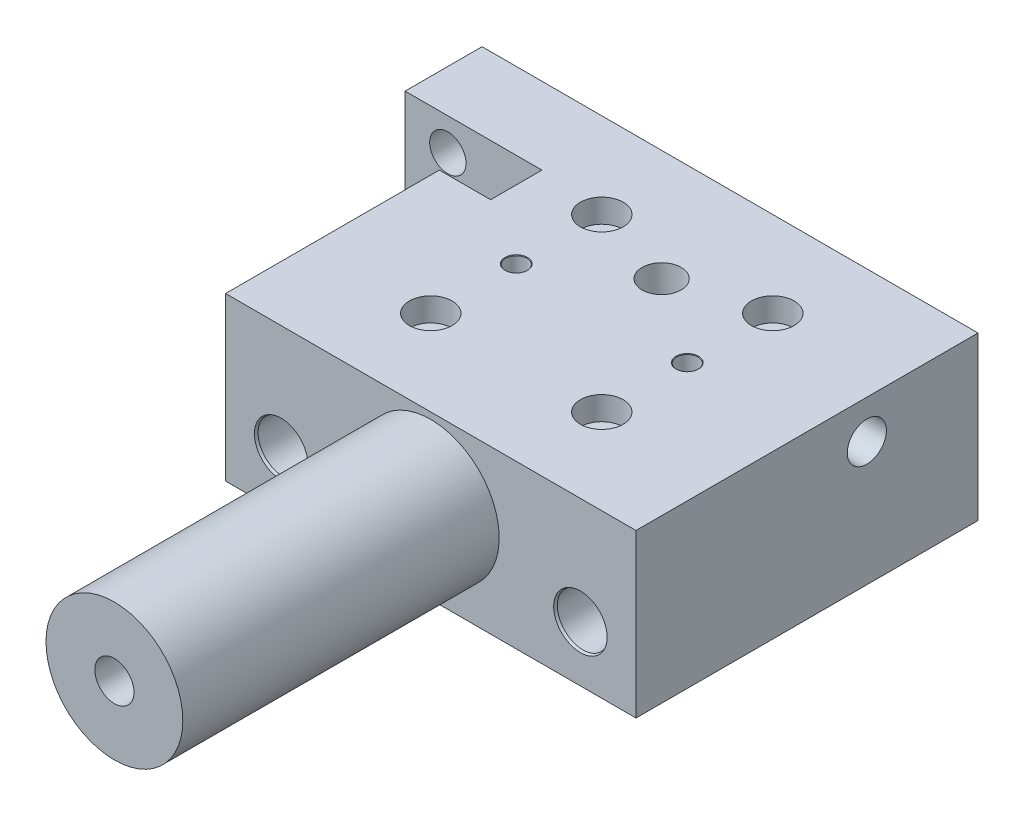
ISO-10303-21;
HEADER;
FILE_DESCRIPTION(('STEP AP214'),'2;1');
FILE_NAME('part.step','',(''),(''),'','','');
FILE_SCHEMA(('AUTOMOTIVE_DESIGN { 1 0 10303 214 1 1 1 1 }'));
ENDSEC;
DATA;
#1=APPLICATION_CONTEXT('core data for automotive mechanical design processes');
#2=APPLICATION_PROTOCOL_DEFINITION('international standard','automotive_design',2000,#1);
#3=PRODUCT_CONTEXT('',#1,'mechanical');
#4=PRODUCT('Part','Part','',(#3));
#5=PRODUCT_RELATED_PRODUCT_CATEGORY('part','',(#4));
#6=PRODUCT_DEFINITION_FORMATION('','',#4);
#7=PRODUCT_DEFINITION_CONTEXT('part definition',#1,'design');
#8=PRODUCT_DEFINITION('design','',#6,#7);
#9=PRODUCT_DEFINITION_SHAPE('','',#8);
#10=(LENGTH_UNIT() NAMED_UNIT(*) SI_UNIT(.MILLI.,.METRE.));
#11=(NAMED_UNIT(*) PLANE_ANGLE_UNIT() SI_UNIT($,.RADIAN.));
#12=(NAMED_UNIT(*) SI_UNIT($,.STERADIAN.) SOLID_ANGLE_UNIT());
#13=UNCERTAINTY_MEASURE_WITH_UNIT(LENGTH_MEASURE(1.E-05),#10,'distance_accuracy_value','');
#14=(GEOMETRIC_REPRESENTATION_CONTEXT(3) GLOBAL_UNCERTAINTY_ASSIGNED_CONTEXT((#13)) GLOBAL_UNIT_ASSIGNED_CONTEXT((#10,
#11,#12)) REPRESENTATION_CONTEXT('',''));
#15=CARTESIAN_POINT('',(0.,0.,0.));
#16=DIRECTION('',(0.,0.,1.));
#17=DIRECTION('',(1.,0.,0.));
#18=AXIS2_PLACEMENT_3D('',#15,#16,#17);
#19=CARTESIAN_POINT('',(0.,4.,-71.));
#20=DIRECTION('',(-1.,0.,0.));
#21=DIRECTION('',(0.,0.,1.));
#22=AXIS2_PLACEMENT_3D('',#19,#20,#21);
#23=CYLINDRICAL_SURFACE('',#22,2.39999999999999);
#24=CARTESIAN_POINT('',(8.99999999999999,4.,-71.));
#25=DIRECTION('',(-1.,0.,0.));
#26=DIRECTION('',(0.,0.,1.));
#27=AXIS2_PLACEMENT_3D('',#24,#25,#26);
#28=CIRCLE('',#27,2.39999999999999);
#29=CARTESIAN_POINT('',(8.99999999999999,4.,-68.6));
#30=VERTEX_POINT('',#29);
#31=EDGE_CURVE('E9355',#30,#30,#28,.T.);
#32=ORIENTED_EDGE('',*,*,#31,.F.);
#33=EDGE_LOOP('',(#32));
#34=FACE_BOUND('',#33,.T.);
#35=CARTESIAN_POINT('',(4.5,4.,-71.));
#36=DIRECTION('',(-1.,0.,0.));
#37=DIRECTION('',(0.,0.,1.));
#38=AXIS2_PLACEMENT_3D('',#35,#36,#37);
#39=CIRCLE('',#38,2.39999999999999);
#40=CARTESIAN_POINT('',(4.5,4.,-68.6));
#41=VERTEX_POINT('',#40);
#42=EDGE_CURVE('E9342',#41,#41,#39,.F.);
#43=ORIENTED_EDGE('',*,*,#42,.F.);
#44=EDGE_LOOP('',(#43));
#45=FACE_BOUND('',#44,.T.);
#46=ADVANCED_FACE('F9174',(#34,#45),#23,.F.);
#47=CARTESIAN_POINT('',(0.,38.,-80.));
#48=DIRECTION('',(1.,0.,0.));
#49=DIRECTION('',(0.,0.,-1.));
#50=AXIS2_PLACEMENT_3D('',#47,#48,#49);
#51=PLANE('',#50);
#52=CARTESIAN_POINT('',(0.,4.,-71.));
#53=DIRECTION('',(-1.,0.,0.));
#54=DIRECTION('',(0.,0.,1.));
#55=AXIS2_PLACEMENT_3D('',#52,#53,#54);
#56=CIRCLE('',#55,4.);
#57=CARTESIAN_POINT('',(0.,3.85832158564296,-67.0025098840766));
#58=VERTEX_POINT('',#57);
#59=CARTESIAN_POINT('',(0.,4.,-75.));
#60=VERTEX_POINT('',#59);
#61=EDGE_CURVE('E9321',#58,#60,#56,.T.);
#62=ORIENTED_EDGE('',*,*,#61,.F.);
#63=DIRECTION('',(0.,1.,0.));
#64=VECTOR('',#63,1.);
#65=CARTESIAN_POINT('',(0.,3.85832158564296,-67.0025098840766));
#66=LINE('',#65,#64);
#67=CARTESIAN_POINT('',(0.,0.,-67.0025098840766));
#68=VERTEX_POINT('',#67);
#69=EDGE_CURVE('E9328',#68,#58,#66,.T.);
#70=ORIENTED_EDGE('',*,*,#69,.F.);
#71=DIRECTION('',(0.,0.,1.));
#72=VECTOR('',#71,1.);
#73=CARTESIAN_POINT('',(0.,0.,-80.));
#74=LINE('',#73,#72);
#75=CARTESIAN_POINT('',(0.,0.,-62.));
#76=VERTEX_POINT('',#75);
#77=EDGE_CURVE('E9548',#68,#76,#74,.T.);
#78=ORIENTED_EDGE('',*,*,#77,.T.);
#79=DIRECTION('',(0.,-1.,0.));
#80=VECTOR('',#79,1.);
#81=CARTESIAN_POINT('',(0.,38.,-62.));
#82=LINE('',#81,#80);
#83=CARTESIAN_POINT('',(0.,38.,-62.));
#84=VERTEX_POINT('',#83);
#85=EDGE_CURVE('E9580',#84,#76,#82,.T.);
#86=ORIENTED_EDGE('',*,*,#85,.F.);
#87=DIRECTION('',(0.,0.,1.));
#88=VECTOR('',#87,1.);
#89=CARTESIAN_POINT('',(0.,38.,-80.));
#90=LINE('',#89,#88);
#91=CARTESIAN_POINT('',(0.,38.,-80.));
#92=VERTEX_POINT('',#91);
#93=EDGE_CURVE('E9565',#92,#84,#90,.T.);
#94=ORIENTED_EDGE('',*,*,#93,.F.);
#95=DIRECTION('',(0.,-1.,0.));
#96=VECTOR('',#95,1.);
#97=CARTESIAN_POINT('',(0.,38.,-80.));
#98=LINE('',#97,#96);
#99=CARTESIAN_POINT('',(0.,0.,-80.));
#100=VERTEX_POINT('',#99);
#101=EDGE_CURVE('E9583',#92,#100,#98,.T.);
#102=ORIENTED_EDGE('',*,*,#101,.T.);
#103=CARTESIAN_POINT('',(0.,0.,-75.));
#104=VERTEX_POINT('',#103);
#105=EDGE_CURVE('E9549',#100,#104,#74,.T.);
#106=ORIENTED_EDGE('',*,*,#105,.T.);
#107=DIRECTION('',(0.,-1.,0.));
#108=VECTOR('',#107,1.);
#109=CARTESIAN_POINT('',(0.,4.,-75.));
#110=LINE('',#109,#108);
#111=EDGE_CURVE('E9326',#60,#104,#110,.T.);
#112=ORIENTED_EDGE('',*,*,#111,.F.);
#113=EDGE_LOOP('',(#62,#70,#78,#86,#94,#102,#106,#112));
#114=FACE_BOUND('',#113,.T.);
#115=ADVANCED_FACE('F9645',(#114),#51,.F.);
#116=CARTESIAN_POINT('',(116.,0.,-80.));
#117=DIRECTION('',(0.,-1.,0.));
#118=DIRECTION('',(0.,0.,-1.));
#119=AXIS2_PLACEMENT_3D('',#116,#117,#118);
#120=PLANE('',#119);
#121=DIRECTION('',(-1.,0.,0.));
#122=VECTOR('',#121,1.);
#123=CARTESIAN_POINT('',(4.5,0.,-67.0025098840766));
#124=LINE('',#123,#122);
#125=CARTESIAN_POINT('',(4.5,0.,-67.0025098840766));
#126=VERTEX_POINT('',#125);
#127=EDGE_CURVE('E9343',#126,#68,#124,.T.);
#128=ORIENTED_EDGE('',*,*,#127,.F.);
#129=DIRECTION('',(0.,0.,1.));
#130=VECTOR('',#129,1.);
#131=CARTESIAN_POINT('',(4.5,0.,-75.));
#132=LINE('',#131,#130);
#133=CARTESIAN_POINT('',(4.5,0.,-75.));
#134=VERTEX_POINT('',#133);
#135=EDGE_CURVE('E9334',#134,#126,#132,.T.);
#136=ORIENTED_EDGE('',*,*,#135,.F.);
#137=DIRECTION('',(-1.,0.,0.));
#138=VECTOR('',#137,1.);
#139=CARTESIAN_POINT('',(4.5,0.,-75.));
#140=LINE('',#139,#138);
#141=EDGE_CURVE('E9345',#134,#104,#140,.T.);
#142=ORIENTED_EDGE('',*,*,#141,.T.);
#143=ORIENTED_EDGE('',*,*,#105,.F.);
#144=DIRECTION('',(-1.,0.,0.));
#145=VECTOR('',#144,1.);
#146=CARTESIAN_POINT('',(0.,0.,-80.));
#147=LINE('',#146,#145);
#148=CARTESIAN_POINT('',(8.99999999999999,0.,-80.));
#149=VERTEX_POINT('',#148);
#150=EDGE_CURVE('E9544',#149,#100,#147,.T.);
#151=ORIENTED_EDGE('',*,*,#150,.F.);
#152=DIRECTION('',(0.,0.,-1.));
#153=VECTOR('',#152,1.);
#154=CARTESIAN_POINT('',(8.99999999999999,0.,-61.));
#155=LINE('',#154,#153);
#156=CARTESIAN_POINT('',(8.99999999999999,0.,-62.));
#157=VERTEX_POINT('',#156);
#158=EDGE_CURVE('E9358',#157,#149,#155,.T.);
#159=ORIENTED_EDGE('',*,*,#158,.F.);
#160=DIRECTION('',(1.,0.,0.));
#161=VECTOR('',#160,1.);
#162=CARTESIAN_POINT('',(0.,0.,-62.));
#163=LINE('',#162,#161);
#164=EDGE_CURVE('E9553',#76,#157,#163,.T.);
#165=ORIENTED_EDGE('',*,*,#164,.F.);
#166=ORIENTED_EDGE('',*,*,#77,.F.);
#167=EDGE_LOOP('',(#128,#136,#142,#143,#151,#159,#165,#166));
#168=FACE_BOUND('',#167,.T.);
#169=ADVANCED_FACE('F9652',(#168),#120,.T.);
#170=CARTESIAN_POINT('',(20.,38.,0.));
#171=DIRECTION('',(0.,0.,-1.));
#172=DIRECTION('',(-1.,0.,0.));
#173=AXIS2_PLACEMENT_3D('',#170,#171,#172);
#174=PLANE('',#173);
#175=DIRECTION('',(1.,0.,0.));
#176=VECTOR('',#175,1.);
#177=CARTESIAN_POINT('',(20.,0.,0.));
#178=LINE('',#177,#176);
#179=CARTESIAN_POINT('',(20.,0.,0.));
#180=VERTEX_POINT('',#179);
#181=CARTESIAN_POINT('',(116.,0.,0.));
#182=VERTEX_POINT('',#181);
#183=EDGE_CURVE('E9558',#180,#182,#178,.T.);
#184=ORIENTED_EDGE('',*,*,#183,.T.);
#185=DIRECTION('',(0.,-1.,0.));
#186=VECTOR('',#185,1.);
#187=CARTESIAN_POINT('',(116.,38.,0.));
#188=LINE('',#187,#186);
#189=CARTESIAN_POINT('',(116.,38.,0.));
#190=VERTEX_POINT('',#189);
#191=EDGE_CURVE('E9572',#190,#182,#188,.T.);
#192=ORIENTED_EDGE('',*,*,#191,.F.);
#193=DIRECTION('',(1.,0.,0.));
#194=VECTOR('',#193,1.);
#195=CARTESIAN_POINT('',(20.,38.,0.));
#196=LINE('',#195,#194);
#197=CARTESIAN_POINT('',(20.,38.,0.));
#198=VERTEX_POINT('',#197);
#199=EDGE_CURVE('E9570',#198,#190,#196,.T.);
#200=ORIENTED_EDGE('',*,*,#199,.F.);
#201=DIRECTION('',(0.,-1.,0.));
#202=VECTOR('',#201,1.);
#203=CARTESIAN_POINT('',(20.,38.,0.));
#204=LINE('',#203,#202);
#205=EDGE_CURVE('E9575',#198,#180,#204,.T.);
#206=ORIENTED_EDGE('',*,*,#205,.T.);
#207=EDGE_LOOP('',(#184,#192,#200,#206));
#208=FACE_BOUND('',#207,.T.);
#209=CARTESIAN_POINT('',(33.,13.,0.));
#210=DIRECTION('',(0.,0.,1.));
#211=DIRECTION('',(1.,0.,0.));
#212=AXIS2_PLACEMENT_3D('',#209,#210,#211);
#213=CIRCLE('',#212,6.25);
#214=CARTESIAN_POINT('',(39.25,13.,0.));
#215=VERTEX_POINT('',#214);
#216=EDGE_CURVE('E9526',#215,#215,#213,.T.);
#217=ORIENTED_EDGE('',*,*,#216,.F.);
#218=EDGE_LOOP('',(#217));
#219=FACE_BOUND('',#218,.T.);
#220=CARTESIAN_POINT('',(103.,13.,0.));
#221=DIRECTION('',(0.,0.,1.));
#222=DIRECTION('',(1.,0.,0.));
#223=AXIS2_PLACEMENT_3D('',#220,#221,#222);
#224=CIRCLE('',#223,6.25000000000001);
#225=CARTESIAN_POINT('',(109.25,13.,0.));
#226=VERTEX_POINT('',#225);
#227=EDGE_CURVE('E9514',#226,#226,#224,.T.);
#228=ORIENTED_EDGE('',*,*,#227,.F.);
#229=EDGE_LOOP('',(#228));
#230=FACE_BOUND('',#229,.T.);
#231=CARTESIAN_POINT('',(68.,20.5,0.));
#232=DIRECTION('',(0.,0.,-1.));
#233=DIRECTION('',(-1.,0.,0.));
#234=AXIS2_PLACEMENT_3D('',#231,#232,#233);
#235=CIRCLE('',#234,16.);
#236=CARTESIAN_POINT('',(52.,20.5,0.));
#237=VERTEX_POINT('',#236);
#238=EDGE_CURVE('E9589',#237,#237,#235,.F.);
#239=ORIENTED_EDGE('',*,*,#238,.F.);
#240=EDGE_LOOP('',(#239));
#241=FACE_BOUND('',#240,.T.);
#242=ADVANCED_FACE('F9626',(#208,#219,#230,#241),#174,.F.);
#243=DIRECTION('',(0.,0.,1.));
#244=VECTOR('',#243,1.);
#245=CARTESIAN_POINT('',(11.,0.,-61.));
#246=LINE('',#245,#244);
#247=CARTESIAN_POINT('',(11.,0.,-80.));
#248=VERTEX_POINT('',#247);
#249=CARTESIAN_POINT('',(11.,0.,-62.));
#250=VERTEX_POINT('',#249);
#251=EDGE_CURVE('E9360',#248,#250,#246,.T.);
#252=ORIENTED_EDGE('',*,*,#251,.F.);
#253=CARTESIAN_POINT('',(116.,0.,-80.));
#254=VERTEX_POINT('',#253);
#255=EDGE_CURVE('E9545',#254,#248,#147,.T.);
#256=ORIENTED_EDGE('',*,*,#255,.F.);
#257=DIRECTION('',(0.,0.,-1.));
#258=VECTOR('',#257,1.);
#259=CARTESIAN_POINT('',(116.,0.,0.));
#260=LINE('',#259,#258);
#261=EDGE_CURVE('E9541',#182,#254,#260,.T.);
#262=ORIENTED_EDGE('',*,*,#261,.F.);
#263=ORIENTED_EDGE('',*,*,#183,.F.);
#264=DIRECTION('',(0.,0.,1.));
#265=VECTOR('',#264,1.);
#266=CARTESIAN_POINT('',(20.,0.,-62.));
#267=LINE('',#266,#265);
#268=CARTESIAN_POINT('',(20.,0.,-62.));
#269=VERTEX_POINT('',#268);
#270=EDGE_CURVE('E9556',#269,#180,#267,.T.);
#271=ORIENTED_EDGE('',*,*,#270,.F.);
#272=EDGE_CURVE('E9552',#250,#269,#163,.T.);
#273=ORIENTED_EDGE('',*,*,#272,.F.);
#274=EDGE_LOOP('',(#252,#256,#262,#263,#271,#273));
#275=FACE_BOUND('',#274,.T.);
#276=CARTESIAN_POINT('',(68.,0.,-54.));
#277=DIRECTION('',(0.,-1.,0.));
#278=DIRECTION('',(0.,0.,-1.));
#279=AXIS2_PLACEMENT_3D('',#276,#277,#278);
#280=CIRCLE('',#279,4.57349999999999);
#281=CARTESIAN_POINT('',(68.,0.,-58.5735));
#282=VERTEX_POINT('',#281);
#283=EDGE_CURVE('E9422',#282,#282,#280,.T.);
#284=ORIENTED_EDGE('',*,*,#283,.F.);
#285=EDGE_LOOP('',(#284));
#286=FACE_BOUND('',#285,.T.);
#287=CARTESIAN_POINT('',(48.,0.,-20.));
#288=DIRECTION('',(0.,-1.,0.));
#289=DIRECTION('',(0.,0.,-1.));
#290=AXIS2_PLACEMENT_3D('',#287,#288,#289);
#291=CIRCLE('',#290,5.);
#292=CARTESIAN_POINT('',(48.,0.,-25.));
#293=VERTEX_POINT('',#292);
#294=EDGE_CURVE('E9425',#293,#293,#291,.T.);
#295=ORIENTED_EDGE('',*,*,#294,.F.);
#296=EDGE_LOOP('',(#295));
#297=FACE_BOUND('',#296,.T.);
#298=CARTESIAN_POINT('',(48.,0.,-60.));
#299=DIRECTION('',(0.,-1.,0.));
#300=DIRECTION('',(0.,0.,-1.));
#301=AXIS2_PLACEMENT_3D('',#298,#299,#300);
#302=CIRCLE('',#301,5.);
#303=CARTESIAN_POINT('',(48.,0.,-65.));
#304=VERTEX_POINT('',#303);
#305=EDGE_CURVE('E9453',#304,#304,#302,.T.);
#306=ORIENTED_EDGE('',*,*,#305,.F.);
#307=EDGE_LOOP('',(#306));
#308=FACE_BOUND('',#307,.T.);
#309=CARTESIAN_POINT('',(88.,0.,-40.));
#310=DIRECTION('',(0.,-1.,0.));
#311=DIRECTION('',(0.,0.,-1.));
#312=AXIS2_PLACEMENT_3D('',#309,#310,#311);
#313=CIRCLE('',#312,2.625);
#314=CARTESIAN_POINT('',(88.,0.,-42.625));
#315=VERTEX_POINT('',#314);
#316=EDGE_CURVE('E9490',#315,#315,#313,.T.);
#317=ORIENTED_EDGE('',*,*,#316,.F.);
#318=EDGE_LOOP('',(#317));
#319=FACE_BOUND('',#318,.T.);
#320=CARTESIAN_POINT('',(48.,0.,-40.));
#321=DIRECTION('',(0.,-1.,0.));
#322=DIRECTION('',(0.,0.,-1.));
#323=AXIS2_PLACEMENT_3D('',#320,#321,#322);
#324=CIRCLE('',#323,2.625);
#325=CARTESIAN_POINT('',(48.,0.,-42.625));
#326=VERTEX_POINT('',#325);
#327=EDGE_CURVE('E9502',#326,#326,#324,.T.);
#328=ORIENTED_EDGE('',*,*,#327,.F.);
#329=EDGE_LOOP('',(#328));
#330=FACE_BOUND('',#329,.T.);
#331=CARTESIAN_POINT('',(88.,0.,-60.));
#332=DIRECTION('',(0.,-1.,0.));
#333=DIRECTION('',(0.,0.,-1.));
#334=AXIS2_PLACEMENT_3D('',#331,#332,#333);
#335=CIRCLE('',#334,5.);
#336=CARTESIAN_POINT('',(88.,0.,-65.));
#337=VERTEX_POINT('',#336);
#338=EDGE_CURVE('E9467',#337,#337,#335,.T.);
#339=ORIENTED_EDGE('',*,*,#338,.F.);
#340=EDGE_LOOP('',(#339));
#341=FACE_BOUND('',#340,.T.);
#342=CARTESIAN_POINT('',(88.,0.,-20.));
#343=DIRECTION('',(0.,-1.,0.));
#344=DIRECTION('',(0.,0.,-1.));
#345=AXIS2_PLACEMENT_3D('',#342,#343,#344);
#346=CIRCLE('',#345,5.);
#347=CARTESIAN_POINT('',(88.,0.,-25.));
#348=VERTEX_POINT('',#347);
#349=EDGE_CURVE('E9439',#348,#348,#346,.T.);
#350=ORIENTED_EDGE('',*,*,#349,.F.);
#351=EDGE_LOOP('',(#350));
#352=FACE_BOUND('',#351,.T.);
#353=ADVANCED_FACE('F9631',(#275,#286,#297,#308,#319,#330,#341,#352),#120,.T.);
#354=CARTESIAN_POINT('',(116.,38.,0.));
#355=DIRECTION('',(-1.,0.,0.));
#356=DIRECTION('',(0.,0.,1.));
#357=AXIS2_PLACEMENT_3D('',#354,#355,#356);
#358=PLANE('',#357);
#359=CARTESIAN_POINT('',(116.,29.,-54.));
#360=DIRECTION('',(1.,0.,0.));
#361=DIRECTION('',(0.,0.,-1.));
#362=AXIS2_PLACEMENT_3D('',#359,#360,#361);
#363=CIRCLE('',#362,4.5735);
#364=CARTESIAN_POINT('',(116.,29.,-58.5735));
#365=VERTEX_POINT('',#364);
#366=EDGE_CURVE('E9398',#365,#365,#363,.T.);
#367=ORIENTED_EDGE('',*,*,#366,.F.);
#368=EDGE_LOOP('',(#367));
#369=FACE_BOUND('',#368,.T.);
#370=ORIENTED_EDGE('',*,*,#261,.T.);
#371=DIRECTION('',(0.,-1.,0.));
#372=VECTOR('',#371,1.);
#373=CARTESIAN_POINT('',(116.,38.,-80.));
#374=LINE('',#373,#372);
#375=CARTESIAN_POINT('',(116.,38.,-80.));
#376=VERTEX_POINT('',#375);
#377=EDGE_CURVE('E9586',#376,#254,#374,.T.);
#378=ORIENTED_EDGE('',*,*,#377,.F.);
#379=DIRECTION('',(0.,0.,-1.));
#380=VECTOR('',#379,1.);
#381=CARTESIAN_POINT('',(116.,38.,0.));
#382=LINE('',#381,#380);
#383=EDGE_CURVE('E9560',#190,#376,#382,.T.);
#384=ORIENTED_EDGE('',*,*,#383,.F.);
#385=ORIENTED_EDGE('',*,*,#191,.T.);
#386=EDGE_LOOP('',(#370,#378,#384,#385));
#387=FACE_BOUND('',#386,.T.);
#388=ADVANCED_FACE('F9176',(#369,#387),#358,.F.);
#389=CARTESIAN_POINT('',(0.,38.,-80.));
#390=DIRECTION('',(0.,0.,1.));
#391=DIRECTION('',(1.,0.,0.));
#392=AXIS2_PLACEMENT_3D('',#389,#390,#391);
#393=PLANE('',#392);
#394=CARTESIAN_POINT('',(103.,13.,-80.));
#395=DIRECTION('',(0.,0.,1.));
#396=DIRECTION('',(1.,0.,0.));
#397=AXIS2_PLACEMENT_3D('',#394,#395,#396);
#398=CIRCLE('',#397,6.24999999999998);
#399=CARTESIAN_POINT('',(109.25,13.,-80.));
#400=VERTEX_POINT('',#399);
#401=EDGE_CURVE('E9505',#400,#400,#398,.T.);
#402=ORIENTED_EDGE('',*,*,#401,.T.);
#403=EDGE_LOOP('',(#402));
#404=FACE_BOUND('',#403,.T.);
#405=CARTESIAN_POINT('',(33.,13.,-80.));
#406=DIRECTION('',(0.,0.,1.));
#407=DIRECTION('',(1.,0.,0.));
#408=AXIS2_PLACEMENT_3D('',#405,#406,#407);
#409=CIRCLE('',#408,6.24999999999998);
#410=CARTESIAN_POINT('',(39.25,13.,-80.));
#411=VERTEX_POINT('',#410);
#412=EDGE_CURVE('E9517',#411,#411,#409,.T.);
#413=ORIENTED_EDGE('',*,*,#412,.T.);
#414=EDGE_LOOP('',(#413));
#415=FACE_BOUND('',#414,.T.);
#416=CARTESIAN_POINT('',(9.99999999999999,30.5,-80.));
#417=DIRECTION('',(0.,0.,1.));
#418=DIRECTION('',(1.,0.,0.));
#419=AXIS2_PLACEMENT_3D('',#416,#417,#418);
#420=CIRCLE('',#419,4.24999999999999);
#421=CARTESIAN_POINT('',(14.25,30.5,-80.));
#422=VERTEX_POINT('',#421);
#423=EDGE_CURVE('E9529',#422,#422,#420,.T.);
#424=ORIENTED_EDGE('',*,*,#423,.T.);
#425=EDGE_LOOP('',(#424));
#426=FACE_BOUND('',#425,.T.);
#427=CARTESIAN_POINT('',(9.99999999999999,13.5,-80.));
#428=DIRECTION('',(0.,0.,1.));
#429=DIRECTION('',(1.,0.,0.));
#430=AXIS2_PLACEMENT_3D('',#427,#428,#429);
#431=CIRCLE('',#430,6.);
#432=CARTESIAN_POINT('',(11.,7.58392021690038,-80.));
#433=VERTEX_POINT('',#432);
#434=CARTESIAN_POINT('',(8.99999999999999,7.58392021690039,-80.));
#435=VERTEX_POINT('',#434);
#436=EDGE_CURVE('E9535',#433,#435,#431,.T.);
#437=ORIENTED_EDGE('',*,*,#436,.T.);
#438=DIRECTION('',(0.,-1.,0.));
#439=VECTOR('',#438,1.);
#440=CARTESIAN_POINT('',(8.99999999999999,38.,-80.));
#441=LINE('',#440,#439);
#442=EDGE_CURVE('E9371',#435,#149,#441,.T.);
#443=ORIENTED_EDGE('',*,*,#442,.T.);
#444=ORIENTED_EDGE('',*,*,#150,.T.);
#445=ORIENTED_EDGE('',*,*,#101,.F.);
#446=DIRECTION('',(-1.,0.,0.));
#447=VECTOR('',#446,1.);
#448=CARTESIAN_POINT('',(0.,38.,-80.));
#449=LINE('',#448,#447);
#450=EDGE_CURVE('E9563',#376,#92,#449,.T.);
#451=ORIENTED_EDGE('',*,*,#450,.F.);
#452=ORIENTED_EDGE('',*,*,#377,.T.);
#453=ORIENTED_EDGE('',*,*,#255,.T.);
#454=DIRECTION('',(0.,1.,0.));
#455=VECTOR('',#454,1.);
#456=CARTESIAN_POINT('',(11.,38.,-80.));
#457=LINE('',#456,#455);
#458=EDGE_CURVE('E9365',#248,#433,#457,.T.);
#459=ORIENTED_EDGE('',*,*,#458,.T.);
#460=EDGE_LOOP('',(#437,#443,#444,#445,#451,#452,#453,#459));
#461=FACE_BOUND('',#460,.T.);
#462=ADVANCED_FACE('F9640',(#404,#415,#426,#461),#393,.F.);
#463=CARTESIAN_POINT('',(0.,38.,-62.));
#464=DIRECTION('',(0.,0.,-1.));
#465=DIRECTION('',(-1.,0.,0.));
#466=AXIS2_PLACEMENT_3D('',#463,#464,#465);
#467=PLANE('',#466);
#468=CARTESIAN_POINT('',(9.99999999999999,30.5,-62.));
#469=DIRECTION('',(0.,0.,1.));
#470=DIRECTION('',(1.,0.,0.));
#471=AXIS2_PLACEMENT_3D('',#468,#469,#470);
#472=CIRCLE('',#471,4.24999999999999);
#473=CARTESIAN_POINT('',(14.25,30.5,-62.));
#474=VERTEX_POINT('',#473);
#475=EDGE_CURVE('E9532',#474,#474,#472,.T.);
#476=ORIENTED_EDGE('',*,*,#475,.F.);
#477=EDGE_LOOP('',(#476));
#478=FACE_BOUND('',#477,.T.);
#479=DIRECTION('',(0.,-1.,0.));
#480=VECTOR('',#479,1.);
#481=CARTESIAN_POINT('',(20.,38.,-62.));
#482=LINE('',#481,#480);
#483=CARTESIAN_POINT('',(20.,26.,-62.));
#484=VERTEX_POINT('',#483);
#485=EDGE_CURVE('E9578',#484,#269,#482,.T.);
#486=ORIENTED_EDGE('',*,*,#485,.F.);
#487=DIRECTION('',(-0.707106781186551,-0.707106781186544,0.));
#488=VECTOR('',#487,1.);
#489=CARTESIAN_POINT('',(19.9999999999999,26.,-62.));
#490=LINE('',#489,#488);
#491=CARTESIAN_POINT('',(32.,38.,-62.));
#492=VERTEX_POINT('',#491);
#493=EDGE_CURVE('E9182',#484,#492,#490,.F.);
#494=ORIENTED_EDGE('',*,*,#493,.T.);
#495=DIRECTION('',(1.,0.,0.));
#496=VECTOR('',#495,1.);
#497=CARTESIAN_POINT('',(0.,38.,-62.));
#498=LINE('',#497,#496);
#499=EDGE_CURVE('E9311',#84,#492,#498,.T.);
#500=ORIENTED_EDGE('',*,*,#499,.F.);
#501=ORIENTED_EDGE('',*,*,#85,.T.);
#502=ORIENTED_EDGE('',*,*,#164,.T.);
#503=DIRECTION('',(0.,1.,0.));
#504=VECTOR('',#503,1.);
#505=CARTESIAN_POINT('',(8.99999999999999,38.,-62.));
#506=LINE('',#505,#504);
#507=CARTESIAN_POINT('',(8.99999999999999,7.58392021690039,-62.));
#508=VERTEX_POINT('',#507);
#509=EDGE_CURVE('E9368',#157,#508,#506,.T.);
#510=ORIENTED_EDGE('',*,*,#509,.T.);
#511=CARTESIAN_POINT('',(9.99999999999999,13.5,-62.));
#512=DIRECTION('',(0.,0.,1.));
#513=DIRECTION('',(1.,0.,0.));
#514=AXIS2_PLACEMENT_3D('',#511,#512,#513);
#515=CIRCLE('',#514,6.);
#516=CARTESIAN_POINT('',(11.,7.58392021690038,-62.));
#517=VERTEX_POINT('',#516);
#518=EDGE_CURVE('E9538',#517,#508,#515,.T.);
#519=ORIENTED_EDGE('',*,*,#518,.F.);
#520=DIRECTION('',(0.,-1.,0.));
#521=VECTOR('',#520,1.);
#522=CARTESIAN_POINT('',(11.,38.,-62.));
#523=LINE('',#522,#521);
#524=EDGE_CURVE('E9362',#517,#250,#523,.T.);
#525=ORIENTED_EDGE('',*,*,#524,.T.);
#526=ORIENTED_EDGE('',*,*,#272,.T.);
#527=EDGE_LOOP('',(#486,#494,#500,#501,#502,#510,#519,#525,#526));
#528=FACE_BOUND('',#527,.T.);
#529=ADVANCED_FACE('F9616',(#478,#528),#467,.F.);
#530=CARTESIAN_POINT('',(20.,38.,-62.));
#531=DIRECTION('',(1.,0.,0.));
#532=DIRECTION('',(0.,0.,-1.));
#533=AXIS2_PLACEMENT_3D('',#530,#531,#532);
#534=PLANE('',#533);
#535=DIRECTION('',(0.,0.,1.));
#536=VECTOR('',#535,1.);
#537=CARTESIAN_POINT('',(20.,38.,-62.));
#538=LINE('',#537,#536);
#539=CARTESIAN_POINT('',(20.,38.,-50.));
#540=VERTEX_POINT('',#539);
#541=EDGE_CURVE('E9568',#540,#198,#538,.T.);
#542=ORIENTED_EDGE('',*,*,#541,.F.);
#543=DIRECTION('',(0.,1.,0.));
#544=VECTOR('',#543,1.);
#545=CARTESIAN_POINT('',(20.,26.,-50.));
#546=LINE('',#545,#544);
#547=CARTESIAN_POINT('',(20.,26.,-50.));
#548=VERTEX_POINT('',#547);
#549=EDGE_CURVE('E9188',#548,#540,#546,.T.);
#550=ORIENTED_EDGE('',*,*,#549,.F.);
#551=DIRECTION('',(0.,0.,1.));
#552=VECTOR('',#551,1.);
#553=CARTESIAN_POINT('',(20.,26.,-50.));
#554=LINE('',#553,#552);
#555=EDGE_CURVE('E9313',#484,#548,#554,.T.);
#556=ORIENTED_EDGE('',*,*,#555,.F.);
#557=ORIENTED_EDGE('',*,*,#485,.T.);
#558=ORIENTED_EDGE('',*,*,#270,.T.);
#559=ORIENTED_EDGE('',*,*,#205,.F.);
#560=EDGE_LOOP('',(#542,#550,#556,#557,#558,#559));
#561=FACE_BOUND('',#560,.T.);
#562=ADVANCED_FACE('F9620',(#561),#534,.F.);
#563=CARTESIAN_POINT('',(116.,38.,-80.));
#564=DIRECTION('',(0.,-1.,0.));
#565=DIRECTION('',(0.,0.,-1.));
#566=AXIS2_PLACEMENT_3D('',#563,#564,#565);
#567=PLANE('',#566);
#568=CARTESIAN_POINT('',(68.,38.,-54.));
#569=DIRECTION('',(0.,1.,0.));
#570=DIRECTION('',(0.,0.,1.));
#571=AXIS2_PLACEMENT_3D('',#568,#569,#570);
#572=CIRCLE('',#571,4.57349999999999);
#573=CARTESIAN_POINT('',(68.,38.,-49.4265));
#574=VERTEX_POINT('',#573);
#575=EDGE_CURVE('E9401',#574,#574,#572,.T.);
#576=ORIENTED_EDGE('',*,*,#575,.F.);
#577=EDGE_LOOP('',(#576));
#578=FACE_BOUND('',#577,.T.);
#579=CARTESIAN_POINT('',(48.,38.,-20.));
#580=DIRECTION('',(0.,1.,0.));
#581=DIRECTION('',(0.,0.,1.));
#582=AXIS2_PLACEMENT_3D('',#579,#580,#581);
#583=CIRCLE('',#582,5.);
#584=CARTESIAN_POINT('',(48.,38.,-15.));
#585=VERTEX_POINT('',#584);
#586=EDGE_CURVE('E9432',#585,#585,#583,.T.);
#587=ORIENTED_EDGE('',*,*,#586,.F.);
#588=EDGE_LOOP('',(#587));
#589=FACE_BOUND('',#588,.T.);
#590=CARTESIAN_POINT('',(88.,38.,-20.));
#591=DIRECTION('',(0.,1.,0.));
#592=DIRECTION('',(0.,0.,1.));
#593=AXIS2_PLACEMENT_3D('',#590,#591,#592);
#594=CIRCLE('',#593,5.);
#595=CARTESIAN_POINT('',(88.,38.,-15.));
#596=VERTEX_POINT('',#595);
#597=EDGE_CURVE('E9446',#596,#596,#594,.T.);
#598=ORIENTED_EDGE('',*,*,#597,.F.);
#599=EDGE_LOOP('',(#598));
#600=FACE_BOUND('',#599,.T.);
#601=CARTESIAN_POINT('',(48.,38.,-60.));
#602=DIRECTION('',(0.,1.,0.));
#603=DIRECTION('',(0.,0.,1.));
#604=AXIS2_PLACEMENT_3D('',#601,#602,#603);
#605=CIRCLE('',#604,5.);
#606=CARTESIAN_POINT('',(48.,38.,-55.));
#607=VERTEX_POINT('',#606);
#608=EDGE_CURVE('E9460',#607,#607,#605,.T.);
#609=ORIENTED_EDGE('',*,*,#608,.F.);
#610=EDGE_LOOP('',(#609));
#611=FACE_BOUND('',#610,.T.);
#612=CARTESIAN_POINT('',(88.,38.,-60.));
#613=DIRECTION('',(0.,1.,0.));
#614=DIRECTION('',(0.,0.,1.));
#615=AXIS2_PLACEMENT_3D('',#612,#613,#614);
#616=CIRCLE('',#615,5.);
#617=CARTESIAN_POINT('',(88.,38.,-55.));
#618=VERTEX_POINT('',#617);
#619=EDGE_CURVE('E9477',#618,#618,#616,.T.);
#620=ORIENTED_EDGE('',*,*,#619,.F.);
#621=EDGE_LOOP('',(#620));
#622=FACE_BOUND('',#621,.T.);
#623=CARTESIAN_POINT('',(88.,38.,-40.));
#624=DIRECTION('',(0.,-1.,0.));
#625=DIRECTION('',(0.,0.,-1.));
#626=AXIS2_PLACEMENT_3D('',#623,#624,#625);
#627=CIRCLE('',#626,2.62499999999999);
#628=CARTESIAN_POINT('',(88.,38.,-42.625));
#629=VERTEX_POINT('',#628);
#630=EDGE_CURVE('E9481',#629,#629,#627,.T.);
#631=ORIENTED_EDGE('',*,*,#630,.T.);
#632=EDGE_LOOP('',(#631));
#633=FACE_BOUND('',#632,.T.);
#634=CARTESIAN_POINT('',(48.,38.,-40.));
#635=DIRECTION('',(0.,-1.,0.));
#636=DIRECTION('',(0.,0.,-1.));
#637=AXIS2_PLACEMENT_3D('',#634,#635,#636);
#638=CIRCLE('',#637,2.62499999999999);
#639=CARTESIAN_POINT('',(48.,38.,-42.625));
#640=VERTEX_POINT('',#639);
#641=EDGE_CURVE('E9493',#640,#640,#638,.T.);
#642=ORIENTED_EDGE('',*,*,#641,.T.);
#643=EDGE_LOOP('',(#642));
#644=FACE_BOUND('',#643,.T.);
#645=ORIENTED_EDGE('',*,*,#499,.T.);
#646=DIRECTION('',(0.,0.,-1.));
#647=VECTOR('',#646,1.);
#648=CARTESIAN_POINT('',(32.,38.,-62.));
#649=LINE('',#648,#647);
#650=CARTESIAN_POINT('',(32.,38.,-50.));
#651=VERTEX_POINT('',#650);
#652=EDGE_CURVE('E9305',#651,#492,#649,.T.);
#653=ORIENTED_EDGE('',*,*,#652,.F.);
#654=DIRECTION('',(1.,0.,0.));
#655=VECTOR('',#654,1.);
#656=CARTESIAN_POINT('',(32.,38.,-50.));
#657=LINE('',#656,#655);
#658=EDGE_CURVE('E9299',#540,#651,#657,.T.);
#659=ORIENTED_EDGE('',*,*,#658,.F.);
#660=ORIENTED_EDGE('',*,*,#541,.T.);
#661=ORIENTED_EDGE('',*,*,#199,.T.);
#662=ORIENTED_EDGE('',*,*,#383,.T.);
#663=ORIENTED_EDGE('',*,*,#450,.T.);
#664=ORIENTED_EDGE('',*,*,#93,.T.);
#665=EDGE_LOOP('',(#645,#653,#659,#660,#661,#662,#663,#664));
#666=FACE_BOUND('',#665,.T.);
#667=ADVANCED_FACE('F9309',(#578,#589,#600,#611,#622,#633,#644,#666),#567,.F.);
#668=CARTESIAN_POINT('',(9.99999999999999,13.5,-62.));
#669=DIRECTION('',(0.,0.,1.));
#670=DIRECTION('',(1.,0.,0.));
#671=AXIS2_PLACEMENT_3D('',#668,#669,#670);
#672=CYLINDRICAL_SURFACE('',#671,6.);
#673=ORIENTED_EDGE('',*,*,#518,.T.);
#674=DIRECTION('',(0.,0.,1.));
#675=VECTOR('',#674,1.);
#676=CARTESIAN_POINT('',(8.99999999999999,7.58392021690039,-62.));
#677=LINE('',#676,#675);
#678=EDGE_CURVE('E9611',#508,#435,#677,.F.);
#679=ORIENTED_EDGE('',*,*,#678,.T.);
#680=ORIENTED_EDGE('',*,*,#436,.F.);
#681=DIRECTION('',(0.,0.,1.));
#682=VECTOR('',#681,1.);
#683=CARTESIAN_POINT('',(11.,7.58392021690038,-62.));
#684=LINE('',#683,#682);
#685=EDGE_CURVE('E9608',#433,#517,#684,.T.);
#686=ORIENTED_EDGE('',*,*,#685,.T.);
#687=EDGE_LOOP('',(#673,#679,#680,#686));
#688=FACE_BOUND('',#687,.T.);
#689=ADVANCED_FACE('F9657',(#688),#672,.F.);
#690=CARTESIAN_POINT('',(9.99999999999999,30.5,-62.));
#691=DIRECTION('',(0.,0.,1.));
#692=DIRECTION('',(1.,0.,0.));
#693=AXIS2_PLACEMENT_3D('',#690,#691,#692);
#694=CYLINDRICAL_SURFACE('',#693,4.24999999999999);
#695=ORIENTED_EDGE('',*,*,#423,.F.);
#696=EDGE_LOOP('',(#695));
#697=FACE_BOUND('',#696,.T.);
#698=ORIENTED_EDGE('',*,*,#475,.T.);
#699=EDGE_LOOP('',(#698));
#700=FACE_BOUND('',#699,.T.);
#701=ADVANCED_FACE('F9789',(#697,#700),#694,.F.);
#702=CARTESIAN_POINT('',(33.,13.,0.));
#703=DIRECTION('',(0.,0.,1.));
#704=DIRECTION('',(1.,0.,0.));
#705=AXIS2_PLACEMENT_3D('',#702,#703,#704);
#706=CONICAL_SURFACE('',#705,6.25,0.392699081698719);
#707=CARTESIAN_POINT('',(33.,13.,-0.6035533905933));
#708=DIRECTION('',(0.,0.,1.));
#709=DIRECTION('',(1.,0.,0.));
#710=AXIS2_PLACEMENT_3D('',#707,#708,#709);
#711=CIRCLE('',#710,5.99999999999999);
#712=CARTESIAN_POINT('',(39.,13.,-0.6035533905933));
#713=VERTEX_POINT('',#712);
#714=EDGE_CURVE('E9523',#713,#713,#711,.T.);
#715=ORIENTED_EDGE('',*,*,#714,.F.);
#716=EDGE_LOOP('',(#715));
#717=FACE_BOUND('',#716,.T.);
#718=ORIENTED_EDGE('',*,*,#216,.T.);
#719=EDGE_LOOP('',(#718));
#720=FACE_BOUND('',#719,.T.);
#721=ADVANCED_FACE('F10199',(#717,#720),#706,.F.);
#722=CARTESIAN_POINT('',(33.,13.,0.));
#723=DIRECTION('',(0.,0.,1.));
#724=DIRECTION('',(1.,0.,0.));
#725=AXIS2_PLACEMENT_3D('',#722,#723,#724);
#726=CYLINDRICAL_SURFACE('',#725,5.99999999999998);
#727=CARTESIAN_POINT('',(33.,13.,-79.3964466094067));
#728=DIRECTION('',(0.,0.,1.));
#729=DIRECTION('',(1.,0.,0.));
#730=AXIS2_PLACEMENT_3D('',#727,#728,#729);
#731=CIRCLE('',#730,5.99999999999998);
#732=CARTESIAN_POINT('',(39.,13.,-79.3964466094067));
#733=VERTEX_POINT('',#732);
#734=EDGE_CURVE('E9520',#733,#733,#731,.T.);
#735=ORIENTED_EDGE('',*,*,#734,.F.);
#736=EDGE_LOOP('',(#735));
#737=FACE_BOUND('',#736,.T.);
#738=ORIENTED_EDGE('',*,*,#714,.T.);
#739=EDGE_LOOP('',(#738));
#740=FACE_BOUND('',#739,.T.);
#741=ADVANCED_FACE('F10191',(#737,#740),#726,.F.);
#742=CARTESIAN_POINT('',(33.,13.,-79.3964466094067));
#743=DIRECTION('',(0.,0.,-1.));
#744=DIRECTION('',(-1.,0.,0.));
#745=AXIS2_PLACEMENT_3D('',#742,#743,#744);
#746=CONICAL_SURFACE('',#745,5.99999999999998,0.392699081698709);
#747=ORIENTED_EDGE('',*,*,#412,.F.);
#748=EDGE_LOOP('',(#747));
#749=FACE_BOUND('',#748,.T.);
#750=ORIENTED_EDGE('',*,*,#734,.T.);
#751=EDGE_LOOP('',(#750));
#752=FACE_BOUND('',#751,.T.);
#753=ADVANCED_FACE('F10183',(#749,#752),#746,.F.);
#754=CARTESIAN_POINT('',(103.,13.,0.));
#755=DIRECTION('',(0.,0.,1.));
#756=DIRECTION('',(1.,0.,0.));
#757=AXIS2_PLACEMENT_3D('',#754,#755,#756);
#758=CONICAL_SURFACE('',#757,6.25000000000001,0.392699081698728);
#759=CARTESIAN_POINT('',(103.,13.,-0.6035533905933));
#760=DIRECTION('',(0.,0.,1.));
#761=DIRECTION('',(1.,0.,0.));
#762=AXIS2_PLACEMENT_3D('',#759,#760,#761);
#763=CIRCLE('',#762,5.99999999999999);
#764=CARTESIAN_POINT('',(109.,13.,-0.6035533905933));
#765=VERTEX_POINT('',#764);
#766=EDGE_CURVE('E9511',#765,#765,#763,.T.);
#767=ORIENTED_EDGE('',*,*,#766,.F.);
#768=EDGE_LOOP('',(#767));
#769=FACE_BOUND('',#768,.T.);
#770=ORIENTED_EDGE('',*,*,#227,.T.);
#771=EDGE_LOOP('',(#770));
#772=FACE_BOUND('',#771,.T.);
#773=ADVANCED_FACE('F10175',(#769,#772),#758,.F.);
#774=CARTESIAN_POINT('',(103.,13.,0.));
#775=DIRECTION('',(0.,0.,1.));
#776=DIRECTION('',(1.,0.,0.));
#777=AXIS2_PLACEMENT_3D('',#774,#775,#776);
#778=CYLINDRICAL_SURFACE('',#777,5.99999999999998);
#779=CARTESIAN_POINT('',(103.,13.,-79.3964466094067));
#780=DIRECTION('',(0.,0.,1.));
#781=DIRECTION('',(1.,0.,0.));
#782=AXIS2_PLACEMENT_3D('',#779,#780,#781);
#783=CIRCLE('',#782,5.99999999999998);
#784=CARTESIAN_POINT('',(109.,13.,-79.3964466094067));
#785=VERTEX_POINT('',#784);
#786=EDGE_CURVE('E9508',#785,#785,#783,.T.);
#787=ORIENTED_EDGE('',*,*,#786,.F.);
#788=EDGE_LOOP('',(#787));
#789=FACE_BOUND('',#788,.T.);
#790=ORIENTED_EDGE('',*,*,#766,.T.);
#791=EDGE_LOOP('',(#790));
#792=FACE_BOUND('',#791,.T.);
#793=ADVANCED_FACE('F10167',(#789,#792),#778,.F.);
#794=CARTESIAN_POINT('',(103.,13.,-79.3964466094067));
#795=DIRECTION('',(0.,0.,-1.));
#796=DIRECTION('',(-1.,0.,0.));
#797=AXIS2_PLACEMENT_3D('',#794,#795,#796);
#798=CONICAL_SURFACE('',#797,5.99999999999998,0.392699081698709);
#799=ORIENTED_EDGE('',*,*,#401,.F.);
#800=EDGE_LOOP('',(#799));
#801=FACE_BOUND('',#800,.T.);
#802=ORIENTED_EDGE('',*,*,#786,.T.);
#803=EDGE_LOOP('',(#802));
#804=FACE_BOUND('',#803,.T.);
#805=ADVANCED_FACE('F10159',(#801,#804),#798,.F.);
#806=CARTESIAN_POINT('',(48.,0.,-40.));
#807=DIRECTION('',(0.,-1.,0.));
#808=DIRECTION('',(0.,0.,-1.));
#809=AXIS2_PLACEMENT_3D('',#806,#807,#808);
#810=CONICAL_SURFACE('',#809,2.625,0.785398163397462);
#811=CARTESIAN_POINT('',(48.,0.125000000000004,-40.));
#812=DIRECTION('',(0.,-1.,0.));
#813=DIRECTION('',(0.,0.,-1.));
#814=AXIS2_PLACEMENT_3D('',#811,#812,#813);
#815=CIRCLE('',#814,2.5);
#816=CARTESIAN_POINT('',(48.,0.125000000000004,-42.5));
#817=VERTEX_POINT('',#816);
#818=EDGE_CURVE('E9499',#817,#817,#815,.T.);
#819=ORIENTED_EDGE('',*,*,#818,.F.);
#820=EDGE_LOOP('',(#819));
#821=FACE_BOUND('',#820,.T.);
#822=ORIENTED_EDGE('',*,*,#327,.T.);
#823=EDGE_LOOP('',(#822));
#824=FACE_BOUND('',#823,.T.);
#825=ADVANCED_FACE('F10151',(#821,#824),#810,.F.);
#826=CARTESIAN_POINT('',(48.,0.,-40.));
#827=DIRECTION('',(0.,-1.,0.));
#828=DIRECTION('',(0.,0.,-1.));
#829=AXIS2_PLACEMENT_3D('',#826,#827,#828);
#830=CYLINDRICAL_SURFACE('',#829,2.5);
#831=CARTESIAN_POINT('',(48.,37.875,-40.));
#832=DIRECTION('',(0.,-1.,0.));
#833=DIRECTION('',(0.,0.,-1.));
#834=AXIS2_PLACEMENT_3D('',#831,#832,#833);
#835=CIRCLE('',#834,2.5);
#836=CARTESIAN_POINT('',(48.,37.875,-42.5));
#837=VERTEX_POINT('',#836);
#838=EDGE_CURVE('E9496',#837,#837,#835,.T.);
#839=ORIENTED_EDGE('',*,*,#838,.F.);
#840=EDGE_LOOP('',(#839));
#841=FACE_BOUND('',#840,.T.);
#842=ORIENTED_EDGE('',*,*,#818,.T.);
#843=EDGE_LOOP('',(#842));
#844=FACE_BOUND('',#843,.T.);
#845=ADVANCED_FACE('F10143',(#841,#844),#830,.F.);
#846=CARTESIAN_POINT('',(48.,37.875,-40.));
#847=DIRECTION('',(0.,1.,0.));
#848=DIRECTION('',(0.,0.,1.));
#849=AXIS2_PLACEMENT_3D('',#846,#847,#848);
#850=CONICAL_SURFACE('',#849,2.5,0.785398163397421);
#851=ORIENTED_EDGE('',*,*,#641,.F.);
#852=EDGE_LOOP('',(#851));
#853=FACE_BOUND('',#852,.T.);
#854=ORIENTED_EDGE('',*,*,#838,.T.);
#855=EDGE_LOOP('',(#854));
#856=FACE_BOUND('',#855,.T.);
#857=ADVANCED_FACE('F10135',(#853,#856),#850,.F.);
#858=CARTESIAN_POINT('',(88.,0.,-40.));
#859=DIRECTION('',(0.,-1.,0.));
#860=DIRECTION('',(0.,0.,-1.));
#861=AXIS2_PLACEMENT_3D('',#858,#859,#860);
#862=CONICAL_SURFACE('',#861,2.625,0.785398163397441);
#863=CARTESIAN_POINT('',(88.,0.125000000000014,-40.));
#864=DIRECTION('',(0.,-1.,0.));
#865=DIRECTION('',(0.,0.,-1.));
#866=AXIS2_PLACEMENT_3D('',#863,#864,#865);
#867=CIRCLE('',#866,2.49999999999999);
#868=CARTESIAN_POINT('',(88.,0.125000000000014,-42.5));
#869=VERTEX_POINT('',#868);
#870=EDGE_CURVE('E9487',#869,#869,#867,.T.);
#871=ORIENTED_EDGE('',*,*,#870,.F.);
#872=EDGE_LOOP('',(#871));
#873=FACE_BOUND('',#872,.T.);
#874=ORIENTED_EDGE('',*,*,#316,.T.);
#875=EDGE_LOOP('',(#874));
#876=FACE_BOUND('',#875,.T.);
#877=ADVANCED_FACE('F10127',(#873,#876),#862,.F.);
#878=CARTESIAN_POINT('',(88.,0.,-40.));
#879=DIRECTION('',(0.,-1.,0.));
#880=DIRECTION('',(0.,0.,-1.));
#881=AXIS2_PLACEMENT_3D('',#878,#879,#880);
#882=CYLINDRICAL_SURFACE('',#881,2.49999999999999);
#883=CARTESIAN_POINT('',(88.,37.875,-40.));
#884=DIRECTION('',(0.,-1.,0.));
#885=DIRECTION('',(0.,0.,-1.));
#886=AXIS2_PLACEMENT_3D('',#883,#884,#885);
#887=CIRCLE('',#886,2.49999999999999);
#888=CARTESIAN_POINT('',(88.,37.875,-42.5));
#889=VERTEX_POINT('',#888);
#890=EDGE_CURVE('E9484',#889,#889,#887,.T.);
#891=ORIENTED_EDGE('',*,*,#890,.F.);
#892=EDGE_LOOP('',(#891));
#893=FACE_BOUND('',#892,.T.);
#894=ORIENTED_EDGE('',*,*,#870,.T.);
#895=EDGE_LOOP('',(#894));
#896=FACE_BOUND('',#895,.T.);
#897=ADVANCED_FACE('F10119',(#893,#896),#882,.F.);
#898=CARTESIAN_POINT('',(88.,37.875,-40.));
#899=DIRECTION('',(0.,1.,0.));
#900=DIRECTION('',(0.,0.,1.));
#901=AXIS2_PLACEMENT_3D('',#898,#899,#900);
#902=CONICAL_SURFACE('',#901,2.49999999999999,0.785398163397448);
#903=ORIENTED_EDGE('',*,*,#630,.F.);
#904=EDGE_LOOP('',(#903));
#905=FACE_BOUND('',#904,.T.);
#906=ORIENTED_EDGE('',*,*,#890,.T.);
#907=EDGE_LOOP('',(#906));
#908=FACE_BOUND('',#907,.T.);
#909=ADVANCED_FACE('F10098',(#905,#908),#902,.F.);
#910=CARTESIAN_POINT('',(88.,38.,-60.));
#911=DIRECTION('',(0.,1.,0.));
#912=DIRECTION('',(0.,0.,1.));
#913=AXIS2_PLACEMENT_3D('',#910,#911,#912);
#914=CYLINDRICAL_SURFACE('',#913,2.49999999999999);
#915=CARTESIAN_POINT('',(88.,5.50000000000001,-60.));
#916=DIRECTION('',(0.,1.,0.));
#917=DIRECTION('',(0.,0.,1.));
#918=AXIS2_PLACEMENT_3D('',#915,#916,#917);
#919=CIRCLE('',#918,2.49999999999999);
#920=CARTESIAN_POINT('',(88.,5.50000000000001,-57.5));
#921=VERTEX_POINT('',#920);
#922=EDGE_CURVE('E9473',#921,#921,#919,.F.);
#923=ORIENTED_EDGE('',*,*,#922,.T.);
#924=EDGE_LOOP('',(#923));
#925=FACE_BOUND('',#924,.T.);
#926=CARTESIAN_POINT('',(88.,32.5,-60.));
#927=DIRECTION('',(0.,-1.,0.));
#928=DIRECTION('',(0.,0.,-1.));
#929=AXIS2_PLACEMENT_3D('',#926,#927,#928);
#930=CIRCLE('',#929,2.49999999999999);
#931=CARTESIAN_POINT('',(88.,32.5,-62.5));
#932=VERTEX_POINT('',#931);
#933=EDGE_CURVE('E9480',#932,#932,#930,.F.);
#934=ORIENTED_EDGE('',*,*,#933,.T.);
#935=EDGE_LOOP('',(#934));
#936=FACE_BOUND('',#935,.T.);
#937=ADVANCED_FACE('F10093',(#925,#936),#914,.F.);
#938=CARTESIAN_POINT('',(88.,32.5,-60.));
#939=DIRECTION('',(0.,-1.,0.));
#940=DIRECTION('',(0.,0.,-1.));
#941=AXIS2_PLACEMENT_3D('',#938,#939,#940);
#942=PLANE('',#941);
#943=CARTESIAN_POINT('',(88.,32.5,-60.));
#944=DIRECTION('',(0.,1.,0.));
#945=DIRECTION('',(0.,0.,1.));
#946=AXIS2_PLACEMENT_3D('',#943,#944,#945);
#947=CIRCLE('',#946,5.);
#948=CARTESIAN_POINT('',(88.,32.5,-55.));
#949=VERTEX_POINT('',#948);
#950=EDGE_CURVE('E9474',#949,#949,#947,.T.);
#951=ORIENTED_EDGE('',*,*,#950,.T.);
#952=EDGE_LOOP('',(#951));
#953=FACE_BOUND('',#952,.T.);
#954=ORIENTED_EDGE('',*,*,#933,.F.);
#955=EDGE_LOOP('',(#954));
#956=FACE_BOUND('',#955,.T.);
#957=ADVANCED_FACE('F10097',(#953,#956),#942,.F.);
#958=CARTESIAN_POINT('',(88.,38.,-60.));
#959=DIRECTION('',(0.,1.,0.));
#960=DIRECTION('',(0.,0.,1.));
#961=AXIS2_PLACEMENT_3D('',#958,#959,#960);
#962=CYLINDRICAL_SURFACE('',#961,5.);
#963=ORIENTED_EDGE('',*,*,#950,.F.);
#964=EDGE_LOOP('',(#963));
#965=FACE_BOUND('',#964,.T.);
#966=ORIENTED_EDGE('',*,*,#619,.T.);
#967=EDGE_LOOP('',(#966));
#968=FACE_BOUND('',#967,.T.);
#969=ADVANCED_FACE('F10087',(#965,#968),#962,.F.);
#970=CARTESIAN_POINT('',(88.,5.5,-60.));
#971=DIRECTION('',(0.,1.,0.));
#972=DIRECTION('',(0.,0.,1.));
#973=AXIS2_PLACEMENT_3D('',#970,#971,#972);
#974=PLANE('',#973);
#975=CARTESIAN_POINT('',(88.,5.5,-60.));
#976=DIRECTION('',(0.,-1.,0.));
#977=DIRECTION('',(0.,0.,-1.));
#978=AXIS2_PLACEMENT_3D('',#975,#976,#977);
#979=CIRCLE('',#978,5.);
#980=CARTESIAN_POINT('',(88.,5.5,-65.));
#981=VERTEX_POINT('',#980);
#982=EDGE_CURVE('E9470',#981,#981,#979,.T.);
#983=ORIENTED_EDGE('',*,*,#982,.T.);
#984=EDGE_LOOP('',(#983));
#985=FACE_BOUND('',#984,.T.);
#986=ORIENTED_EDGE('',*,*,#922,.F.);
#987=EDGE_LOOP('',(#986));
#988=FACE_BOUND('',#987,.T.);
#989=ADVANCED_FACE('F10079',(#985,#988),#974,.F.);
#990=CARTESIAN_POINT('',(88.,0.,-60.));
#991=DIRECTION('',(0.,-1.,0.));
#992=DIRECTION('',(0.,0.,-1.));
#993=AXIS2_PLACEMENT_3D('',#990,#991,#992);
#994=CYLINDRICAL_SURFACE('',#993,5.);
#995=ORIENTED_EDGE('',*,*,#982,.F.);
#996=EDGE_LOOP('',(#995));
#997=FACE_BOUND('',#996,.T.);
#998=ORIENTED_EDGE('',*,*,#338,.T.);
#999=EDGE_LOOP('',(#998));
#1000=FACE_BOUND('',#999,.T.);
#1001=ADVANCED_FACE('F10058',(#997,#1000),#994,.F.);
#1002=CARTESIAN_POINT('',(48.,38.,-60.));
#1003=DIRECTION('',(0.,1.,0.));
#1004=DIRECTION('',(0.,0.,1.));
#1005=AXIS2_PLACEMENT_3D('',#1002,#1003,#1004);
#1006=CYLINDRICAL_SURFACE('',#1005,2.49999999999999);
#1007=CARTESIAN_POINT('',(48.,5.50000000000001,-60.));
#1008=DIRECTION('',(0.,1.,0.));
#1009=DIRECTION('',(0.,0.,1.));
#1010=AXIS2_PLACEMENT_3D('',#1007,#1008,#1009);
#1011=CIRCLE('',#1010,2.49999999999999);
#1012=CARTESIAN_POINT('',(48.,5.50000000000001,-57.5));
#1013=VERTEX_POINT('',#1012);
#1014=EDGE_CURVE('E9459',#1013,#1013,#1011,.F.);
#1015=ORIENTED_EDGE('',*,*,#1014,.T.);
#1016=EDGE_LOOP('',(#1015));
#1017=FACE_BOUND('',#1016,.T.);
#1018=CARTESIAN_POINT('',(48.,32.5,-60.));
#1019=DIRECTION('',(0.,-1.,0.));
#1020=DIRECTION('',(0.,0.,-1.));
#1021=AXIS2_PLACEMENT_3D('',#1018,#1019,#1020);
#1022=CIRCLE('',#1021,2.49999999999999);
#1023=CARTESIAN_POINT('',(48.,32.5,-62.5));
#1024=VERTEX_POINT('',#1023);
#1025=EDGE_CURVE('E9466',#1024,#1024,#1022,.F.);
#1026=ORIENTED_EDGE('',*,*,#1025,.T.);
#1027=EDGE_LOOP('',(#1026));
#1028=FACE_BOUND('',#1027,.T.);
#1029=ADVANCED_FACE('F10053',(#1017,#1028),#1006,.F.);
#1030=CARTESIAN_POINT('',(48.,32.5,-60.));
#1031=DIRECTION('',(0.,-1.,0.));
#1032=DIRECTION('',(0.,0.,-1.));
#1033=AXIS2_PLACEMENT_3D('',#1030,#1031,#1032);
#1034=PLANE('',#1033);
#1035=CARTESIAN_POINT('',(48.,32.5,-60.));
#1036=DIRECTION('',(0.,1.,0.));
#1037=DIRECTION('',(0.,0.,1.));
#1038=AXIS2_PLACEMENT_3D('',#1035,#1036,#1037);
#1039=CIRCLE('',#1038,5.);
#1040=CARTESIAN_POINT('',(48.,32.5,-55.));
#1041=VERTEX_POINT('',#1040);
#1042=EDGE_CURVE('E9463',#1041,#1041,#1039,.T.);
#1043=ORIENTED_EDGE('',*,*,#1042,.T.);
#1044=EDGE_LOOP('',(#1043));
#1045=FACE_BOUND('',#1044,.T.);
#1046=ORIENTED_EDGE('',*,*,#1025,.F.);
#1047=EDGE_LOOP('',(#1046));
#1048=FACE_BOUND('',#1047,.T.);
#1049=ADVANCED_FACE('F10057',(#1045,#1048),#1034,.F.);
#1050=CARTESIAN_POINT('',(48.,38.,-60.));
#1051=DIRECTION('',(0.,1.,0.));
#1052=DIRECTION('',(0.,0.,1.));
#1053=AXIS2_PLACEMENT_3D('',#1050,#1051,#1052);
#1054=CYLINDRICAL_SURFACE('',#1053,5.);
#1055=ORIENTED_EDGE('',*,*,#1042,.F.);
#1056=EDGE_LOOP('',(#1055));
#1057=FACE_BOUND('',#1056,.T.);
#1058=ORIENTED_EDGE('',*,*,#608,.T.);
#1059=EDGE_LOOP('',(#1058));
#1060=FACE_BOUND('',#1059,.T.);
#1061=ADVANCED_FACE('F10047',(#1057,#1060),#1054,.F.);
#1062=CARTESIAN_POINT('',(48.,5.5,-60.));
#1063=DIRECTION('',(0.,1.,0.));
#1064=DIRECTION('',(0.,0.,1.));
#1065=AXIS2_PLACEMENT_3D('',#1062,#1063,#1064);
#1066=PLANE('',#1065);
#1067=CARTESIAN_POINT('',(48.,5.5,-60.));
#1068=DIRECTION('',(0.,-1.,0.));
#1069=DIRECTION('',(0.,0.,-1.));
#1070=AXIS2_PLACEMENT_3D('',#1067,#1068,#1069);
#1071=CIRCLE('',#1070,5.);
#1072=CARTESIAN_POINT('',(48.,5.5,-65.));
#1073=VERTEX_POINT('',#1072);
#1074=EDGE_CURVE('E9456',#1073,#1073,#1071,.T.);
#1075=ORIENTED_EDGE('',*,*,#1074,.T.);
#1076=EDGE_LOOP('',(#1075));
#1077=FACE_BOUND('',#1076,.T.);
#1078=ORIENTED_EDGE('',*,*,#1014,.F.);
#1079=EDGE_LOOP('',(#1078));
#1080=FACE_BOUND('',#1079,.T.);
#1081=ADVANCED_FACE('F10039',(#1077,#1080),#1066,.F.);
#1082=CARTESIAN_POINT('',(48.,0.,-60.));
#1083=DIRECTION('',(0.,-1.,0.));
#1084=DIRECTION('',(0.,0.,-1.));
#1085=AXIS2_PLACEMENT_3D('',#1082,#1083,#1084);
#1086=CYLINDRICAL_SURFACE('',#1085,5.);
#1087=ORIENTED_EDGE('',*,*,#1074,.F.);
#1088=EDGE_LOOP('',(#1087));
#1089=FACE_BOUND('',#1088,.T.);
#1090=ORIENTED_EDGE('',*,*,#305,.T.);
#1091=EDGE_LOOP('',(#1090));
#1092=FACE_BOUND('',#1091,.T.);
#1093=ADVANCED_FACE('F10018',(#1089,#1092),#1086,.F.);
#1094=CARTESIAN_POINT('',(88.,38.,-20.));
#1095=DIRECTION('',(0.,1.,0.));
#1096=DIRECTION('',(0.,0.,1.));
#1097=AXIS2_PLACEMENT_3D('',#1094,#1095,#1096);
#1098=CYLINDRICAL_SURFACE('',#1097,2.49999999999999);
#1099=CARTESIAN_POINT('',(88.,5.50000000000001,-20.));
#1100=DIRECTION('',(0.,1.,0.));
#1101=DIRECTION('',(0.,0.,1.));
#1102=AXIS2_PLACEMENT_3D('',#1099,#1100,#1101);
#1103=CIRCLE('',#1102,2.49999999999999);
#1104=CARTESIAN_POINT('',(88.,5.50000000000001,-17.5));
#1105=VERTEX_POINT('',#1104);
#1106=EDGE_CURVE('E9445',#1105,#1105,#1103,.F.);
#1107=ORIENTED_EDGE('',*,*,#1106,.T.);
#1108=EDGE_LOOP('',(#1107));
#1109=FACE_BOUND('',#1108,.T.);
#1110=CARTESIAN_POINT('',(88.,32.5,-20.));
#1111=DIRECTION('',(0.,-1.,0.));
#1112=DIRECTION('',(0.,0.,-1.));
#1113=AXIS2_PLACEMENT_3D('',#1110,#1111,#1112);
#1114=CIRCLE('',#1113,2.49999999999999);
#1115=CARTESIAN_POINT('',(88.,32.5,-22.5));
#1116=VERTEX_POINT('',#1115);
#1117=EDGE_CURVE('E9452',#1116,#1116,#1114,.F.);
#1118=ORIENTED_EDGE('',*,*,#1117,.T.);
#1119=EDGE_LOOP('',(#1118));
#1120=FACE_BOUND('',#1119,.T.);
#1121=ADVANCED_FACE('F10013',(#1109,#1120),#1098,.F.);
#1122=CARTESIAN_POINT('',(88.,32.5,-20.));
#1123=DIRECTION('',(0.,-1.,0.));
#1124=DIRECTION('',(0.,0.,-1.));
#1125=AXIS2_PLACEMENT_3D('',#1122,#1123,#1124);
#1126=PLANE('',#1125);
#1127=CARTESIAN_POINT('',(88.,32.5,-20.));
#1128=DIRECTION('',(0.,1.,0.));
#1129=DIRECTION('',(0.,0.,1.));
#1130=AXIS2_PLACEMENT_3D('',#1127,#1128,#1129);
#1131=CIRCLE('',#1130,5.);
#1132=CARTESIAN_POINT('',(88.,32.5,-15.));
#1133=VERTEX_POINT('',#1132);
#1134=EDGE_CURVE('E9449',#1133,#1133,#1131,.T.);
#1135=ORIENTED_EDGE('',*,*,#1134,.T.);
#1136=EDGE_LOOP('',(#1135));
#1137=FACE_BOUND('',#1136,.T.);
#1138=ORIENTED_EDGE('',*,*,#1117,.F.);
#1139=EDGE_LOOP('',(#1138));
#1140=FACE_BOUND('',#1139,.T.);
#1141=ADVANCED_FACE('F10017',(#1137,#1140),#1126,.F.);
#1142=CARTESIAN_POINT('',(88.,38.,-20.));
#1143=DIRECTION('',(0.,1.,0.));
#1144=DIRECTION('',(0.,0.,1.));
#1145=AXIS2_PLACEMENT_3D('',#1142,#1143,#1144);
#1146=CYLINDRICAL_SURFACE('',#1145,5.);
#1147=ORIENTED_EDGE('',*,*,#1134,.F.);
#1148=EDGE_LOOP('',(#1147));
#1149=FACE_BOUND('',#1148,.T.);
#1150=ORIENTED_EDGE('',*,*,#597,.T.);
#1151=EDGE_LOOP('',(#1150));
#1152=FACE_BOUND('',#1151,.T.);
#1153=ADVANCED_FACE('F10007',(#1149,#1152),#1146,.F.);
#1154=CARTESIAN_POINT('',(88.,5.5,-20.));
#1155=DIRECTION('',(0.,1.,0.));
#1156=DIRECTION('',(0.,0.,1.));
#1157=AXIS2_PLACEMENT_3D('',#1154,#1155,#1156);
#1158=PLANE('',#1157);
#1159=CARTESIAN_POINT('',(88.,5.5,-20.));
#1160=DIRECTION('',(0.,-1.,0.));
#1161=DIRECTION('',(0.,0.,-1.));
#1162=AXIS2_PLACEMENT_3D('',#1159,#1160,#1161);
#1163=CIRCLE('',#1162,5.);
#1164=CARTESIAN_POINT('',(88.,5.5,-25.));
#1165=VERTEX_POINT('',#1164);
#1166=EDGE_CURVE('E9442',#1165,#1165,#1163,.T.);
#1167=ORIENTED_EDGE('',*,*,#1166,.T.);
#1168=EDGE_LOOP('',(#1167));
#1169=FACE_BOUND('',#1168,.T.);
#1170=ORIENTED_EDGE('',*,*,#1106,.F.);
#1171=EDGE_LOOP('',(#1170));
#1172=FACE_BOUND('',#1171,.T.);
#1173=ADVANCED_FACE('F9999',(#1169,#1172),#1158,.F.);
#1174=CARTESIAN_POINT('',(88.,0.,-20.));
#1175=DIRECTION('',(0.,-1.,0.));
#1176=DIRECTION('',(0.,0.,-1.));
#1177=AXIS2_PLACEMENT_3D('',#1174,#1175,#1176);
#1178=CYLINDRICAL_SURFACE('',#1177,5.);
#1179=ORIENTED_EDGE('',*,*,#1166,.F.);
#1180=EDGE_LOOP('',(#1179));
#1181=FACE_BOUND('',#1180,.T.);
#1182=ORIENTED_EDGE('',*,*,#349,.T.);
#1183=EDGE_LOOP('',(#1182));
#1184=FACE_BOUND('',#1183,.T.);
#1185=ADVANCED_FACE('F9979',(#1181,#1184),#1178,.F.);
#1186=CARTESIAN_POINT('',(48.,38.,-20.));
#1187=DIRECTION('',(0.,1.,0.));
#1188=DIRECTION('',(0.,0.,1.));
#1189=AXIS2_PLACEMENT_3D('',#1186,#1187,#1188);
#1190=CYLINDRICAL_SURFACE('',#1189,2.49999999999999);
#1191=CARTESIAN_POINT('',(48.,5.50000000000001,-20.));
#1192=DIRECTION('',(0.,1.,0.));
#1193=DIRECTION('',(0.,0.,1.));
#1194=AXIS2_PLACEMENT_3D('',#1191,#1192,#1193);
#1195=CIRCLE('',#1194,2.49999999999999);
#1196=CARTESIAN_POINT('',(48.,5.50000000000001,-17.5));
#1197=VERTEX_POINT('',#1196);
#1198=EDGE_CURVE('E9431',#1197,#1197,#1195,.F.);
#1199=ORIENTED_EDGE('',*,*,#1198,.T.);
#1200=EDGE_LOOP('',(#1199));
#1201=FACE_BOUND('',#1200,.T.);
#1202=CARTESIAN_POINT('',(48.,32.5,-20.));
#1203=DIRECTION('',(0.,-1.,0.));
#1204=DIRECTION('',(0.,0.,-1.));
#1205=AXIS2_PLACEMENT_3D('',#1202,#1203,#1204);
#1206=CIRCLE('',#1205,2.49999999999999);
#1207=CARTESIAN_POINT('',(48.,32.5,-22.5));
#1208=VERTEX_POINT('',#1207);
#1209=EDGE_CURVE('E9438',#1208,#1208,#1206,.F.);
#1210=ORIENTED_EDGE('',*,*,#1209,.T.);
#1211=EDGE_LOOP('',(#1210));
#1212=FACE_BOUND('',#1211,.T.);
#1213=ADVANCED_FACE('F9975',(#1201,#1212),#1190,.F.);
#1214=CARTESIAN_POINT('',(48.,32.5,-20.));
#1215=DIRECTION('',(0.,-1.,0.));
#1216=DIRECTION('',(0.,0.,-1.));
#1217=AXIS2_PLACEMENT_3D('',#1214,#1215,#1216);
#1218=PLANE('',#1217);
#1219=CARTESIAN_POINT('',(48.,32.5,-20.));
#1220=DIRECTION('',(0.,1.,0.));
#1221=DIRECTION('',(0.,0.,1.));
#1222=AXIS2_PLACEMENT_3D('',#1219,#1220,#1221);
#1223=CIRCLE('',#1222,5.);
#1224=CARTESIAN_POINT('',(48.,32.5,-15.));
#1225=VERTEX_POINT('',#1224);
#1226=EDGE_CURVE('E9435',#1225,#1225,#1223,.T.);
#1227=ORIENTED_EDGE('',*,*,#1226,.T.);
#1228=EDGE_LOOP('',(#1227));
#1229=FACE_BOUND('',#1228,.T.);
#1230=ORIENTED_EDGE('',*,*,#1209,.F.);
#1231=EDGE_LOOP('',(#1230));
#1232=FACE_BOUND('',#1231,.T.);
#1233=ADVANCED_FACE('F9978',(#1229,#1232),#1218,.F.);
#1234=CARTESIAN_POINT('',(48.,38.,-20.));
#1235=DIRECTION('',(0.,1.,0.));
#1236=DIRECTION('',(0.,0.,1.));
#1237=AXIS2_PLACEMENT_3D('',#1234,#1235,#1236);
#1238=CYLINDRICAL_SURFACE('',#1237,5.);
#1239=ORIENTED_EDGE('',*,*,#1226,.F.);
#1240=EDGE_LOOP('',(#1239));
#1241=FACE_BOUND('',#1240,.T.);
#1242=ORIENTED_EDGE('',*,*,#586,.T.);
#1243=EDGE_LOOP('',(#1242));
#1244=FACE_BOUND('',#1243,.T.);
#1245=ADVANCED_FACE('F9969',(#1241,#1244),#1238,.F.);
#1246=CARTESIAN_POINT('',(48.,5.5,-20.));
#1247=DIRECTION('',(0.,1.,0.));
#1248=DIRECTION('',(0.,0.,1.));
#1249=AXIS2_PLACEMENT_3D('',#1246,#1247,#1248);
#1250=PLANE('',#1249);
#1251=CARTESIAN_POINT('',(48.,5.5,-20.));
#1252=DIRECTION('',(0.,-1.,0.));
#1253=DIRECTION('',(0.,0.,-1.));
#1254=AXIS2_PLACEMENT_3D('',#1251,#1252,#1253);
#1255=CIRCLE('',#1254,5.);
#1256=CARTESIAN_POINT('',(48.,5.5,-25.));
#1257=VERTEX_POINT('',#1256);
#1258=EDGE_CURVE('E9428',#1257,#1257,#1255,.T.);
#1259=ORIENTED_EDGE('',*,*,#1258,.T.);
#1260=EDGE_LOOP('',(#1259));
#1261=FACE_BOUND('',#1260,.T.);
#1262=ORIENTED_EDGE('',*,*,#1198,.F.);
#1263=EDGE_LOOP('',(#1262));
#1264=FACE_BOUND('',#1263,.T.);
#1265=ADVANCED_FACE('F9961',(#1261,#1264),#1250,.F.);
#1266=CARTESIAN_POINT('',(48.,0.,-20.));
#1267=DIRECTION('',(0.,-1.,0.));
#1268=DIRECTION('',(0.,0.,-1.));
#1269=AXIS2_PLACEMENT_3D('',#1266,#1267,#1268);
#1270=CYLINDRICAL_SURFACE('',#1269,5.);
#1271=ORIENTED_EDGE('',*,*,#1258,.F.);
#1272=EDGE_LOOP('',(#1271));
#1273=FACE_BOUND('',#1272,.T.);
#1274=ORIENTED_EDGE('',*,*,#294,.T.);
#1275=EDGE_LOOP('',(#1274));
#1276=FACE_BOUND('',#1275,.T.);
#1277=ADVANCED_FACE('F9953',(#1273,#1276),#1270,.F.);
#1278=CARTESIAN_POINT('',(68.,0.,-54.));
#1279=DIRECTION('',(0.,-1.,0.));
#1280=DIRECTION('',(0.,0.,-1.));
#1281=AXIS2_PLACEMENT_3D('',#1278,#1279,#1280);
#1282=CONICAL_SURFACE('',#1281,4.57349999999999,0.0312064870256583);
#1283=CARTESIAN_POINT('',(68.,7.4,-54.));
#1284=DIRECTION('',(0.,-1.,0.));
#1285=DIRECTION('',(0.,0.,-1.));
#1286=AXIS2_PLACEMENT_3D('',#1283,#1284,#1285);
#1287=CIRCLE('',#1286,4.34249700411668);
#1288=CARTESIAN_POINT('',(68.,7.4,-58.3424970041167));
#1289=VERTEX_POINT('',#1288);
#1290=EDGE_CURVE('E9419',#1289,#1289,#1287,.T.);
#1291=ORIENTED_EDGE('',*,*,#1290,.F.);
#1292=EDGE_LOOP('',(#1291));
#1293=FACE_BOUND('',#1292,.T.);
#1294=ORIENTED_EDGE('',*,*,#283,.T.);
#1295=EDGE_LOOP('',(#1294));
#1296=FACE_BOUND('',#1295,.T.);
#1297=ADVANCED_FACE('F9945',(#1293,#1296),#1282,.F.);
#1298=CARTESIAN_POINT('',(71.95,7.4,-54.));
#1299=DIRECTION('',(0.,1.,0.));
#1300=DIRECTION('',(0.,0.,1.));
#1301=AXIS2_PLACEMENT_3D('',#1298,#1299,#1300);
#1302=PLANE('',#1301);
#1303=CARTESIAN_POINT('',(68.,7.4,-54.));
#1304=DIRECTION('',(0.,-1.,0.));
#1305=DIRECTION('',(0.,0.,-1.));
#1306=AXIS2_PLACEMENT_3D('',#1303,#1304,#1305);
#1307=CIRCLE('',#1306,3.95000000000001);
#1308=CARTESIAN_POINT('',(68.,7.4,-57.95));
#1309=VERTEX_POINT('',#1308);
#1310=EDGE_CURVE('E9416',#1309,#1309,#1307,.T.);
#1311=ORIENTED_EDGE('',*,*,#1310,.F.);
#1312=EDGE_LOOP('',(#1311));
#1313=FACE_BOUND('',#1312,.T.);
#1314=ORIENTED_EDGE('',*,*,#1290,.T.);
#1315=EDGE_LOOP('',(#1314));
#1316=FACE_BOUND('',#1315,.T.);
#1317=ADVANCED_FACE('F9937',(#1313,#1316),#1302,.F.);
#1318=CARTESIAN_POINT('',(68.,0.,-54.));
#1319=DIRECTION('',(0.,-1.,0.));
#1320=DIRECTION('',(0.,0.,-1.));
#1321=AXIS2_PLACEMENT_3D('',#1318,#1319,#1320);
#1322=CYLINDRICAL_SURFACE('',#1321,3.95000000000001);
#1323=CARTESIAN_POINT('',(68.,11.935,-54.));
#1324=DIRECTION('',(0.,-1.,0.));
#1325=DIRECTION('',(0.,0.,-1.));
#1326=AXIS2_PLACEMENT_3D('',#1323,#1324,#1325);
#1327=CIRCLE('',#1326,3.95000000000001);
#1328=CARTESIAN_POINT('',(68.,11.935,-57.95));
#1329=VERTEX_POINT('',#1328);
#1330=EDGE_CURVE('E9413',#1329,#1329,#1327,.T.);
#1331=ORIENTED_EDGE('',*,*,#1330,.F.);
#1332=EDGE_LOOP('',(#1331));
#1333=FACE_BOUND('',#1332,.T.);
#1334=ORIENTED_EDGE('',*,*,#1310,.T.);
#1335=EDGE_LOOP('',(#1334));
#1336=FACE_BOUND('',#1335,.T.);
#1337=ADVANCED_FACE('F9929',(#1333,#1336),#1322,.F.);
#1338=CARTESIAN_POINT('',(68.,11.935,-54.));
#1339=DIRECTION('',(0.,-1.,0.));
#1340=DIRECTION('',(0.,0.,-1.));
#1341=AXIS2_PLACEMENT_3D('',#1338,#1339,#1340);
#1342=CONICAL_SURFACE('',#1341,3.95000000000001,1.02974425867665);
#1343=CARTESIAN_POINT('',(68.,14.3083994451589,-54.));
#1344=VERTEX_POINT('',#1343);
#1345=VERTEX_LOOP('',#1344);
#1346=FACE_BOUND('',#1345,.T.);
#1347=ORIENTED_EDGE('',*,*,#1330,.T.);
#1348=EDGE_LOOP('',(#1347));
#1349=FACE_BOUND('',#1348,.T.);
#1350=ADVANCED_FACE('F9921',(#1346,#1349),#1342,.F.);
#1351=CARTESIAN_POINT('',(68.,26.065,-54.));
#1352=DIRECTION('',(0.,1.,0.));
#1353=DIRECTION('',(0.,0.,1.));
#1354=AXIS2_PLACEMENT_3D('',#1351,#1352,#1353);
#1355=CONICAL_SURFACE('',#1354,3.95000000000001,1.02974425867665);
#1356=CARTESIAN_POINT('',(68.,23.6916005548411,-54.));
#1357=VERTEX_POINT('',#1356);
#1358=VERTEX_LOOP('',#1357);
#1359=FACE_BOUND('',#1358,.T.);
#1360=CARTESIAN_POINT('',(68.,26.065,-54.));
#1361=DIRECTION('',(0.,1.,0.));
#1362=DIRECTION('',(0.,0.,1.));
#1363=AXIS2_PLACEMENT_3D('',#1360,#1361,#1362);
#1364=CIRCLE('',#1363,3.95000000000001);
#1365=CARTESIAN_POINT('',(68.,26.065,-50.05));
#1366=VERTEX_POINT('',#1365);
#1367=EDGE_CURVE('E9410',#1366,#1366,#1364,.T.);
#1368=ORIENTED_EDGE('',*,*,#1367,.T.);
#1369=EDGE_LOOP('',(#1368));
#1370=FACE_BOUND('',#1369,.T.);
#1371=ADVANCED_FACE('F9913',(#1359,#1370),#1355,.F.);
#1372=CARTESIAN_POINT('',(68.,38.,-54.));
#1373=DIRECTION('',(0.,1.,0.));
#1374=DIRECTION('',(0.,0.,1.));
#1375=AXIS2_PLACEMENT_3D('',#1372,#1373,#1374);
#1376=CYLINDRICAL_SURFACE('',#1375,3.95);
#1377=ORIENTED_EDGE('',*,*,#1367,.F.);
#1378=EDGE_LOOP('',(#1377));
#1379=FACE_BOUND('',#1378,.T.);
#1380=CARTESIAN_POINT('',(68.,30.6,-54.));
#1381=DIRECTION('',(0.,1.,0.));
#1382=DIRECTION('',(0.,0.,1.));
#1383=AXIS2_PLACEMENT_3D('',#1380,#1381,#1382);
#1384=CIRCLE('',#1383,3.95);
#1385=CARTESIAN_POINT('',(68.,30.6,-50.05));
#1386=VERTEX_POINT('',#1385);
#1387=EDGE_CURVE('E9407',#1386,#1386,#1384,.T.);
#1388=ORIENTED_EDGE('',*,*,#1387,.T.);
#1389=EDGE_LOOP('',(#1388));
#1390=FACE_BOUND('',#1389,.T.);
#1391=ADVANCED_FACE('F9905',(#1379,#1390),#1376,.F.);
#1392=CARTESIAN_POINT('',(71.95,30.6,-54.));
#1393=DIRECTION('',(0.,-1.,0.));
#1394=DIRECTION('',(0.,0.,-1.));
#1395=AXIS2_PLACEMENT_3D('',#1392,#1393,#1394);
#1396=PLANE('',#1395);
#1397=ORIENTED_EDGE('',*,*,#1387,.F.);
#1398=EDGE_LOOP('',(#1397));
#1399=FACE_BOUND('',#1398,.T.);
#1400=CARTESIAN_POINT('',(68.,30.6,-54.));
#1401=DIRECTION('',(0.,1.,0.));
#1402=DIRECTION('',(0.,0.,1.));
#1403=AXIS2_PLACEMENT_3D('',#1400,#1401,#1402);
#1404=CIRCLE('',#1403,4.34249700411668);
#1405=CARTESIAN_POINT('',(68.,30.6,-49.6575029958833));
#1406=VERTEX_POINT('',#1405);
#1407=EDGE_CURVE('E9404',#1406,#1406,#1404,.T.);
#1408=ORIENTED_EDGE('',*,*,#1407,.T.);
#1409=EDGE_LOOP('',(#1408));
#1410=FACE_BOUND('',#1409,.T.);
#1411=ADVANCED_FACE('F9897',(#1399,#1410),#1396,.F.);
#1412=CARTESIAN_POINT('',(68.,38.,-54.));
#1413=DIRECTION('',(0.,1.,0.));
#1414=DIRECTION('',(0.,0.,1.));
#1415=AXIS2_PLACEMENT_3D('',#1412,#1413,#1414);
#1416=CONICAL_SURFACE('',#1415,4.57349999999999,0.0312064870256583);
#1417=ORIENTED_EDGE('',*,*,#1407,.F.);
#1418=EDGE_LOOP('',(#1417));
#1419=FACE_BOUND('',#1418,.T.);
#1420=ORIENTED_EDGE('',*,*,#575,.T.);
#1421=EDGE_LOOP('',(#1420));
#1422=FACE_BOUND('',#1421,.T.);
#1423=ADVANCED_FACE('F9884',(#1419,#1422),#1416,.F.);
#1424=CARTESIAN_POINT('',(116.,29.,-54.));
#1425=DIRECTION('',(1.,0.,0.));
#1426=DIRECTION('',(0.,0.,-1.));
#1427=AXIS2_PLACEMENT_3D('',#1424,#1425,#1426);
#1428=CONICAL_SURFACE('',#1427,4.5735,0.0312064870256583);
#1429=CARTESIAN_POINT('',(108.6,29.,-54.));
#1430=DIRECTION('',(1.,0.,0.));
#1431=DIRECTION('',(0.,0.,-1.));
#1432=AXIS2_PLACEMENT_3D('',#1429,#1430,#1431);
#1433=CIRCLE('',#1432,4.34249700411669);
#1434=CARTESIAN_POINT('',(108.6,29.,-58.3424970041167));
#1435=VERTEX_POINT('',#1434);
#1436=EDGE_CURVE('E9395',#1435,#1435,#1433,.T.);
#1437=ORIENTED_EDGE('',*,*,#1436,.F.);
#1438=EDGE_LOOP('',(#1437));
#1439=FACE_BOUND('',#1438,.T.);
#1440=ORIENTED_EDGE('',*,*,#366,.T.);
#1441=EDGE_LOOP('',(#1440));
#1442=FACE_BOUND('',#1441,.T.);
#1443=ADVANCED_FACE('F9876',(#1439,#1442),#1428,.F.);
#1444=CARTESIAN_POINT('',(108.6,32.95,-54.));
#1445=DIRECTION('',(-1.,0.,0.));
#1446=DIRECTION('',(0.,0.,1.));
#1447=AXIS2_PLACEMENT_3D('',#1444,#1445,#1446);
#1448=PLANE('',#1447);
#1449=CARTESIAN_POINT('',(108.6,29.,-54.));
#1450=DIRECTION('',(1.,0.,0.));
#1451=DIRECTION('',(0.,0.,-1.));
#1452=AXIS2_PLACEMENT_3D('',#1449,#1450,#1451);
#1453=CIRCLE('',#1452,3.95000000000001);
#1454=CARTESIAN_POINT('',(108.6,29.,-57.95));
#1455=VERTEX_POINT('',#1454);
#1456=EDGE_CURVE('E9392',#1455,#1455,#1453,.T.);
#1457=ORIENTED_EDGE('',*,*,#1456,.F.);
#1458=EDGE_LOOP('',(#1457));
#1459=FACE_BOUND('',#1458,.T.);
#1460=ORIENTED_EDGE('',*,*,#1436,.T.);
#1461=EDGE_LOOP('',(#1460));
#1462=FACE_BOUND('',#1461,.T.);
#1463=ADVANCED_FACE('F9868',(#1459,#1462),#1448,.F.);
#1464=CARTESIAN_POINT('',(116.,29.,-54.));
#1465=DIRECTION('',(1.,0.,0.));
#1466=DIRECTION('',(0.,0.,-1.));
#1467=AXIS2_PLACEMENT_3D('',#1464,#1465,#1466);
#1468=CYLINDRICAL_SURFACE('',#1467,3.95000000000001);
#1469=CARTESIAN_POINT('',(104.065,29.,-54.));
#1470=DIRECTION('',(1.,0.,0.));
#1471=DIRECTION('',(0.,0.,-1.));
#1472=AXIS2_PLACEMENT_3D('',#1469,#1470,#1471);
#1473=CIRCLE('',#1472,3.95000000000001);
#1474=CARTESIAN_POINT('',(104.065,29.,-57.95));
#1475=VERTEX_POINT('',#1474);
#1476=EDGE_CURVE('E9389',#1475,#1475,#1473,.T.);
#1477=ORIENTED_EDGE('',*,*,#1476,.F.);
#1478=EDGE_LOOP('',(#1477));
#1479=FACE_BOUND('',#1478,.T.);
#1480=ORIENTED_EDGE('',*,*,#1456,.T.);
#1481=EDGE_LOOP('',(#1480));
#1482=FACE_BOUND('',#1481,.T.);
#1483=ADVANCED_FACE('F9860',(#1479,#1482),#1468,.F.);
#1484=CARTESIAN_POINT('',(104.065,29.,-54.));
#1485=DIRECTION('',(1.,0.,0.));
#1486=DIRECTION('',(0.,0.,-1.));
#1487=AXIS2_PLACEMENT_3D('',#1484,#1485,#1486);
#1488=CONICAL_SURFACE('',#1487,3.95000000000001,1.02974425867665);
#1489=CARTESIAN_POINT('',(101.691600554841,29.,-54.));
#1490=VERTEX_POINT('',#1489);
#1491=VERTEX_LOOP('',#1490);
#1492=FACE_BOUND('',#1491,.T.);
#1493=ORIENTED_EDGE('',*,*,#1476,.T.);
#1494=EDGE_LOOP('',(#1493));
#1495=FACE_BOUND('',#1494,.T.);
#1496=ADVANCED_FACE('F9846',(#1492,#1495),#1488,.F.);
#1497=CARTESIAN_POINT('',(68.,20.5,74.));
#1498=DIRECTION('',(0.,0.,-1.));
#1499=DIRECTION('',(-1.,0.,0.));
#1500=AXIS2_PLACEMENT_3D('',#1497,#1498,#1499);
#1501=CYLINDRICAL_SURFACE('',#1500,16.);
#1502=CARTESIAN_POINT('',(68.,20.5,74.));
#1503=DIRECTION('',(0.,0.,1.));
#1504=DIRECTION('',(1.,0.,0.));
#1505=AXIS2_PLACEMENT_3D('',#1502,#1503,#1504);
#1506=CIRCLE('',#1505,16.);
#1507=CARTESIAN_POINT('',(84.,20.5,74.));
#1508=VERTEX_POINT('',#1507);
#1509=EDGE_CURVE('E9386',#1508,#1508,#1506,.T.);
#1510=ORIENTED_EDGE('',*,*,#1509,.F.);
#1511=EDGE_LOOP('',(#1510));
#1512=FACE_BOUND('',#1511,.T.);
#1513=ORIENTED_EDGE('',*,*,#238,.T.);
#1514=EDGE_LOOP('',(#1513));
#1515=FACE_BOUND('',#1514,.T.);
#1516=ADVANCED_FACE('F9838',(#1512,#1515),#1501,.T.);
#1517=CARTESIAN_POINT('',(68.,20.5,74.));
#1518=DIRECTION('',(0.,0.,1.));
#1519=DIRECTION('',(1.,0.,0.));
#1520=AXIS2_PLACEMENT_3D('',#1517,#1518,#1519);
#1521=PLANE('',#1520);
#1522=CARTESIAN_POINT('',(68.,20.5,74.));
#1523=DIRECTION('',(0.,0.,1.));
#1524=DIRECTION('',(1.,0.,0.));
#1525=AXIS2_PLACEMENT_3D('',#1522,#1523,#1524);
#1526=CIRCLE('',#1525,4.57349999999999);
#1527=CARTESIAN_POINT('',(72.5735,20.5,74.));
#1528=VERTEX_POINT('',#1527);
#1529=EDGE_CURVE('E9374',#1528,#1528,#1526,.T.);
#1530=ORIENTED_EDGE('',*,*,#1529,.F.);
#1531=EDGE_LOOP('',(#1530));
#1532=FACE_BOUND('',#1531,.T.);
#1533=ORIENTED_EDGE('',*,*,#1509,.T.);
#1534=EDGE_LOOP('',(#1533));
#1535=FACE_BOUND('',#1534,.T.);
#1536=ADVANCED_FACE('F9830',(#1532,#1535),#1521,.T.);
#1537=CARTESIAN_POINT('',(68.,20.5,62.065));
#1538=DIRECTION('',(0.,0.,1.));
#1539=DIRECTION('',(1.,0.,0.));
#1540=AXIS2_PLACEMENT_3D('',#1537,#1538,#1539);
#1541=CONICAL_SURFACE('',#1540,3.95,1.02974425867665);
#1542=CARTESIAN_POINT('',(68.,20.5,59.6916005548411));
#1543=VERTEX_POINT('',#1542);
#1544=VERTEX_LOOP('',#1543);
#1545=FACE_BOUND('',#1544,.T.);
#1546=CARTESIAN_POINT('',(68.,20.5,62.065));
#1547=DIRECTION('',(0.,0.,1.));
#1548=DIRECTION('',(1.,0.,0.));
#1549=AXIS2_PLACEMENT_3D('',#1546,#1547,#1548);
#1550=CIRCLE('',#1549,3.95);
#1551=CARTESIAN_POINT('',(71.95,20.5,62.065));
#1552=VERTEX_POINT('',#1551);
#1553=EDGE_CURVE('E9383',#1552,#1552,#1550,.T.);
#1554=ORIENTED_EDGE('',*,*,#1553,.T.);
#1555=EDGE_LOOP('',(#1554));
#1556=FACE_BOUND('',#1555,.T.);
#1557=ADVANCED_FACE('F9822',(#1545,#1556),#1541,.F.);
#1558=CARTESIAN_POINT('',(68.,20.5,74.));
#1559=DIRECTION('',(0.,0.,1.));
#1560=DIRECTION('',(1.,0.,0.));
#1561=AXIS2_PLACEMENT_3D('',#1558,#1559,#1560);
#1562=CYLINDRICAL_SURFACE('',#1561,3.95);
#1563=ORIENTED_EDGE('',*,*,#1553,.F.);
#1564=EDGE_LOOP('',(#1563));
#1565=FACE_BOUND('',#1564,.T.);
#1566=CARTESIAN_POINT('',(68.,20.5,66.6));
#1567=DIRECTION('',(0.,0.,1.));
#1568=DIRECTION('',(1.,0.,0.));
#1569=AXIS2_PLACEMENT_3D('',#1566,#1567,#1568);
#1570=CIRCLE('',#1569,3.95);
#1571=CARTESIAN_POINT('',(71.95,20.5,66.6));
#1572=VERTEX_POINT('',#1571);
#1573=EDGE_CURVE('E9380',#1572,#1572,#1570,.T.);
#1574=ORIENTED_EDGE('',*,*,#1573,.T.);
#1575=EDGE_LOOP('',(#1574));
#1576=FACE_BOUND('',#1575,.T.);
#1577=ADVANCED_FACE('F9814',(#1565,#1576),#1562,.F.);
#1578=CARTESIAN_POINT('',(71.95,20.5,66.6));
#1579=DIRECTION('',(0.,0.,-1.));
#1580=DIRECTION('',(-1.,0.,0.));
#1581=AXIS2_PLACEMENT_3D('',#1578,#1579,#1580);
#1582=PLANE('',#1581);
#1583=ORIENTED_EDGE('',*,*,#1573,.F.);
#1584=EDGE_LOOP('',(#1583));
#1585=FACE_BOUND('',#1584,.T.);
#1586=CARTESIAN_POINT('',(68.,20.5,66.6));
#1587=DIRECTION('',(0.,0.,1.));
#1588=DIRECTION('',(1.,0.,0.));
#1589=AXIS2_PLACEMENT_3D('',#1586,#1587,#1588);
#1590=CIRCLE('',#1589,4.34249700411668);
#1591=CARTESIAN_POINT('',(72.3424970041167,20.5,66.6));
#1592=VERTEX_POINT('',#1591);
#1593=EDGE_CURVE('E9377',#1592,#1592,#1590,.T.);
#1594=ORIENTED_EDGE('',*,*,#1593,.T.);
#1595=EDGE_LOOP('',(#1594));
#1596=FACE_BOUND('',#1595,.T.);
#1597=ADVANCED_FACE('F9673',(#1585,#1596),#1582,.F.);
#1598=CARTESIAN_POINT('',(68.,20.5,74.));
#1599=DIRECTION('',(0.,0.,1.));
#1600=DIRECTION('',(1.,0.,0.));
#1601=AXIS2_PLACEMENT_3D('',#1598,#1599,#1600);
#1602=CONICAL_SURFACE('',#1601,4.57349999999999,0.0312064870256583);
#1603=ORIENTED_EDGE('',*,*,#1593,.F.);
#1604=EDGE_LOOP('',(#1603));
#1605=FACE_BOUND('',#1604,.T.);
#1606=ORIENTED_EDGE('',*,*,#1529,.T.);
#1607=EDGE_LOOP('',(#1606));
#1608=FACE_BOUND('',#1607,.T.);
#1609=ADVANCED_FACE('F9662',(#1605,#1608),#1602,.F.);
#1610=CARTESIAN_POINT('',(11.,13.5,-61.));
#1611=DIRECTION('',(1.,0.,0.));
#1612=DIRECTION('',(0.,0.,-1.));
#1613=AXIS2_PLACEMENT_3D('',#1610,#1611,#1612);
#1614=PLANE('',#1613);
#1615=CARTESIAN_POINT('',(11.,4.,-71.));
#1616=DIRECTION('',(-1.,0.,0.));
#1617=DIRECTION('',(0.,0.,1.));
#1618=AXIS2_PLACEMENT_3D('',#1615,#1616,#1617);
#1619=CIRCLE('',#1618,1.64999999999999);
#1620=CARTESIAN_POINT('',(11.,4.,-69.35));
#1621=VERTEX_POINT('',#1620);
#1622=EDGE_CURVE('E9349',#1621,#1621,#1619,.T.);
#1623=ORIENTED_EDGE('',*,*,#1622,.F.);
#1624=EDGE_LOOP('',(#1623));
#1625=FACE_BOUND('',#1624,.T.);
#1626=ORIENTED_EDGE('',*,*,#251,.T.);
#1627=ORIENTED_EDGE('',*,*,#524,.F.);
#1628=ORIENTED_EDGE('',*,*,#685,.F.);
#1629=ORIENTED_EDGE('',*,*,#458,.F.);
#1630=EDGE_LOOP('',(#1626,#1627,#1628,#1629));
#1631=FACE_BOUND('',#1630,.T.);
#1632=ADVANCED_FACE('F9660',(#1625,#1631),#1614,.F.);
#1633=CARTESIAN_POINT('',(8.99999999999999,13.5,-61.));
#1634=DIRECTION('',(-1.,0.,0.));
#1635=DIRECTION('',(0.,0.,1.));
#1636=AXIS2_PLACEMENT_3D('',#1633,#1634,#1635);
#1637=PLANE('',#1636);
#1638=ORIENTED_EDGE('',*,*,#31,.T.);
#1639=EDGE_LOOP('',(#1638));
#1640=FACE_BOUND('',#1639,.T.);
#1641=ORIENTED_EDGE('',*,*,#678,.F.);
#1642=ORIENTED_EDGE('',*,*,#509,.F.);
#1643=ORIENTED_EDGE('',*,*,#158,.T.);
#1644=ORIENTED_EDGE('',*,*,#442,.F.);
#1645=EDGE_LOOP('',(#1641,#1642,#1643,#1644));
#1646=FACE_BOUND('',#1645,.T.);
#1647=ADVANCED_FACE('F9654',(#1640,#1646),#1637,.F.);
#1648=CARTESIAN_POINT('',(21.1,4.,-71.));
#1649=DIRECTION('',(-1.,0.,0.));
#1650=DIRECTION('',(0.,0.,1.));
#1651=AXIS2_PLACEMENT_3D('',#1648,#1649,#1650);
#1652=CONICAL_SURFACE('',#1651,1.64999999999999,1.02974425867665);
#1653=CARTESIAN_POINT('',(22.0914200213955,4.,-71.));
#1654=VERTEX_POINT('',#1653);
#1655=VERTEX_LOOP('',#1654);
#1656=FACE_BOUND('',#1655,.T.);
#1657=CARTESIAN_POINT('',(21.1,4.,-71.));
#1658=DIRECTION('',(-1.,0.,0.));
#1659=DIRECTION('',(0.,0.,1.));
#1660=AXIS2_PLACEMENT_3D('',#1657,#1658,#1659);
#1661=CIRCLE('',#1660,1.64999999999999);
#1662=CARTESIAN_POINT('',(21.1,4.,-69.35));
#1663=VERTEX_POINT('',#1662);
#1664=EDGE_CURVE('E9352',#1663,#1663,#1661,.T.);
#1665=ORIENTED_EDGE('',*,*,#1664,.T.);
#1666=EDGE_LOOP('',(#1665));
#1667=FACE_BOUND('',#1666,.T.);
#1668=ADVANCED_FACE('F9669',(#1656,#1667),#1652,.F.);
#1669=CARTESIAN_POINT('',(11.,4.,-71.));
#1670=DIRECTION('',(-1.,0.,0.));
#1671=DIRECTION('',(0.,0.,1.));
#1672=AXIS2_PLACEMENT_3D('',#1669,#1670,#1671);
#1673=CYLINDRICAL_SURFACE('',#1672,1.64999999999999);
#1674=ORIENTED_EDGE('',*,*,#1664,.F.);
#1675=EDGE_LOOP('',(#1674));
#1676=FACE_BOUND('',#1675,.T.);
#1677=ORIENTED_EDGE('',*,*,#1622,.T.);
#1678=EDGE_LOOP('',(#1677));
#1679=FACE_BOUND('',#1678,.T.);
#1680=ADVANCED_FACE('F9689',(#1676,#1679),#1673,.F.);
#1681=CARTESIAN_POINT('',(4.5,4.,-71.));
#1682=DIRECTION('',(-1.,0.,0.));
#1683=DIRECTION('',(0.,0.,1.));
#1684=AXIS2_PLACEMENT_3D('',#1681,#1682,#1683);
#1685=PLANE('',#1684);
#1686=CARTESIAN_POINT('',(4.5,4.,-71.));
#1687=DIRECTION('',(-1.,0.,0.));
#1688=DIRECTION('',(0.,0.,1.));
#1689=AXIS2_PLACEMENT_3D('',#1686,#1687,#1688);
#1690=CIRCLE('',#1689,4.);
#1691=CARTESIAN_POINT('',(4.5,3.85832158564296,-67.0025098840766));
#1692=VERTEX_POINT('',#1691);
#1693=CARTESIAN_POINT('',(4.5,4.,-75.));
#1694=VERTEX_POINT('',#1693);
#1695=EDGE_CURVE('E9331',#1692,#1694,#1690,.T.);
#1696=ORIENTED_EDGE('',*,*,#1695,.T.);
#1697=DIRECTION('',(0.,-1.,0.));
#1698=VECTOR('',#1697,1.);
#1699=CARTESIAN_POINT('',(4.5,4.,-75.));
#1700=LINE('',#1699,#1698);
#1701=EDGE_CURVE('E9196',#1694,#134,#1700,.T.);
#1702=ORIENTED_EDGE('',*,*,#1701,.T.);
#1703=ORIENTED_EDGE('',*,*,#135,.T.);
#1704=DIRECTION('',(0.,1.,0.));
#1705=VECTOR('',#1704,1.);
#1706=CARTESIAN_POINT('',(4.5,3.85832158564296,-67.0025098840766));
#1707=LINE('',#1706,#1705);
#1708=EDGE_CURVE('E9336',#126,#1692,#1707,.T.);
#1709=ORIENTED_EDGE('',*,*,#1708,.T.);
#1710=EDGE_LOOP('',(#1696,#1702,#1703,#1709));
#1711=FACE_BOUND('',#1710,.T.);
#1712=ORIENTED_EDGE('',*,*,#42,.T.);
#1713=EDGE_LOOP('',(#1712));
#1714=FACE_BOUND('',#1713,.T.);
#1715=ADVANCED_FACE('F9693',(#1711,#1714),#1685,.T.);
#1716=CARTESIAN_POINT('',(4.5,4.,-71.));
#1717=DIRECTION('',(-1.,0.,0.));
#1718=DIRECTION('',(0.,0.,1.));
#1719=AXIS2_PLACEMENT_3D('',#1716,#1717,#1718);
#1720=CYLINDRICAL_SURFACE('',#1719,4.);
#1721=ORIENTED_EDGE('',*,*,#61,.T.);
#1722=DIRECTION('',(-1.,0.,0.));
#1723=VECTOR('',#1722,1.);
#1724=CARTESIAN_POINT('',(4.5,4.,-75.));
#1725=LINE('',#1724,#1723);
#1726=EDGE_CURVE('E9339',#1694,#60,#1725,.T.);
#1727=ORIENTED_EDGE('',*,*,#1726,.F.);
#1728=ORIENTED_EDGE('',*,*,#1695,.F.);
#1729=DIRECTION('',(-1.,0.,0.));
#1730=VECTOR('',#1729,1.);
#1731=CARTESIAN_POINT('',(4.5,3.85832158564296,-67.0025098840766));
#1732=LINE('',#1731,#1730);
#1733=EDGE_CURVE('E9340',#1692,#58,#1732,.T.);
#1734=ORIENTED_EDGE('',*,*,#1733,.T.);
#1735=EDGE_LOOP('',(#1721,#1727,#1728,#1734));
#1736=FACE_BOUND('',#1735,.T.);
#1737=ADVANCED_FACE('F9695',(#1736),#1720,.F.);
#1738=CARTESIAN_POINT('',(4.5,3.85832158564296,-67.0025098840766));
#1739=DIRECTION('',(0.,0.,1.));
#1740=DIRECTION('',(0.,-1.,0.));
#1741=AXIS2_PLACEMENT_3D('',#1738,#1739,#1740);
#1742=PLANE('',#1741);
#1743=ORIENTED_EDGE('',*,*,#69,.T.);
#1744=ORIENTED_EDGE('',*,*,#1733,.F.);
#1745=ORIENTED_EDGE('',*,*,#1708,.F.);
#1746=ORIENTED_EDGE('',*,*,#127,.T.);
#1747=EDGE_LOOP('',(#1743,#1744,#1745,#1746));
#1748=FACE_BOUND('',#1747,.T.);
#1749=ADVANCED_FACE('F9698',(#1748),#1742,.F.);
#1750=CARTESIAN_POINT('',(4.5,4.,-75.));
#1751=DIRECTION('',(0.,0.,-1.));
#1752=DIRECTION('',(0.,1.,0.));
#1753=AXIS2_PLACEMENT_3D('',#1750,#1751,#1752);
#1754=PLANE('',#1753);
#1755=ORIENTED_EDGE('',*,*,#111,.T.);
#1756=ORIENTED_EDGE('',*,*,#141,.F.);
#1757=ORIENTED_EDGE('',*,*,#1701,.F.);
#1758=ORIENTED_EDGE('',*,*,#1726,.T.);
#1759=EDGE_LOOP('',(#1755,#1756,#1757,#1758));
#1760=FACE_BOUND('',#1759,.T.);
#1761=ADVANCED_FACE('F9700',(#1760),#1754,.F.);
#1762=CARTESIAN_POINT('',(32.,26.,-50.));
#1763=DIRECTION('',(0.,0.,1.));
#1764=DIRECTION('',(1.,0.,0.));
#1765=AXIS2_PLACEMENT_3D('',#1762,#1763,#1764);
#1766=PLANE('',#1765);
#1767=ORIENTED_EDGE('',*,*,#658,.T.);
#1768=DIRECTION('',(0.707106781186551,0.707106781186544,0.));
#1769=VECTOR('',#1768,1.);
#1770=CARTESIAN_POINT('',(19.9999999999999,26.,-50.));
#1771=LINE('',#1770,#1769);
#1772=EDGE_CURVE('E11',#651,#548,#1771,.F.);
#1773=ORIENTED_EDGE('',*,*,#1772,.T.);
#1774=ORIENTED_EDGE('',*,*,#549,.T.);
#1775=EDGE_LOOP('',(#1767,#1773,#1774));
#1776=FACE_BOUND('',#1775,.T.);
#1777=ADVANCED_FACE('F9301',(#1776),#1766,.F.);
#1778=CARTESIAN_POINT('',(19.9999999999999,26.,-62.));
#1779=DIRECTION('',(-0.707106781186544,0.707106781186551,0.));
#1780=DIRECTION('',(-0.707106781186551,-0.707106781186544,0.));
#1781=AXIS2_PLACEMENT_3D('',#1778,#1779,#1780);
#1782=PLANE('',#1781);
#1783=ORIENTED_EDGE('',*,*,#1772,.F.);
#1784=ORIENTED_EDGE('',*,*,#652,.T.);
#1785=ORIENTED_EDGE('',*,*,#493,.F.);
#1786=ORIENTED_EDGE('',*,*,#555,.T.);
#1787=EDGE_LOOP('',(#1783,#1784,#1785,#1786));
#1788=FACE_BOUND('',#1787,.T.);
#1789=ADVANCED_FACE('F9316',(#1788),#1782,.T.);
#1790=CLOSED_SHELL('',(#46,#115,#169,#242,#353,#388,#462,#529,#562,#667,#689,#701,#721,#741,
#753,#773,#793,#805,#825,#845,#857,#877,#897,#909,#937,#957,#969,#989,#1001,#1029,#1049,#1061,
#1081,#1093,#1121,#1141,#1153,#1173,#1185,#1213,#1233,#1245,#1265,#1277,#1297,#1317,#1337,#1350,
#1371,#1391,#1411,#1423,#1443,#1463,#1483,#1496,#1516,#1536,#1557,#1577,#1597,#1609,#1632,#1647,
#1668,#1680,#1715,#1737,#1749,#1761,#1777,#1789));
#1791=MANIFOLD_SOLID_BREP('B2',#1790);
#1792=ADVANCED_BREP_SHAPE_REPRESENTATION('',(#18,#1791),#14);
#1793=SHAPE_DEFINITION_REPRESENTATION(#9,#1792);
ENDSEC;
END-ISO-10303-21;
